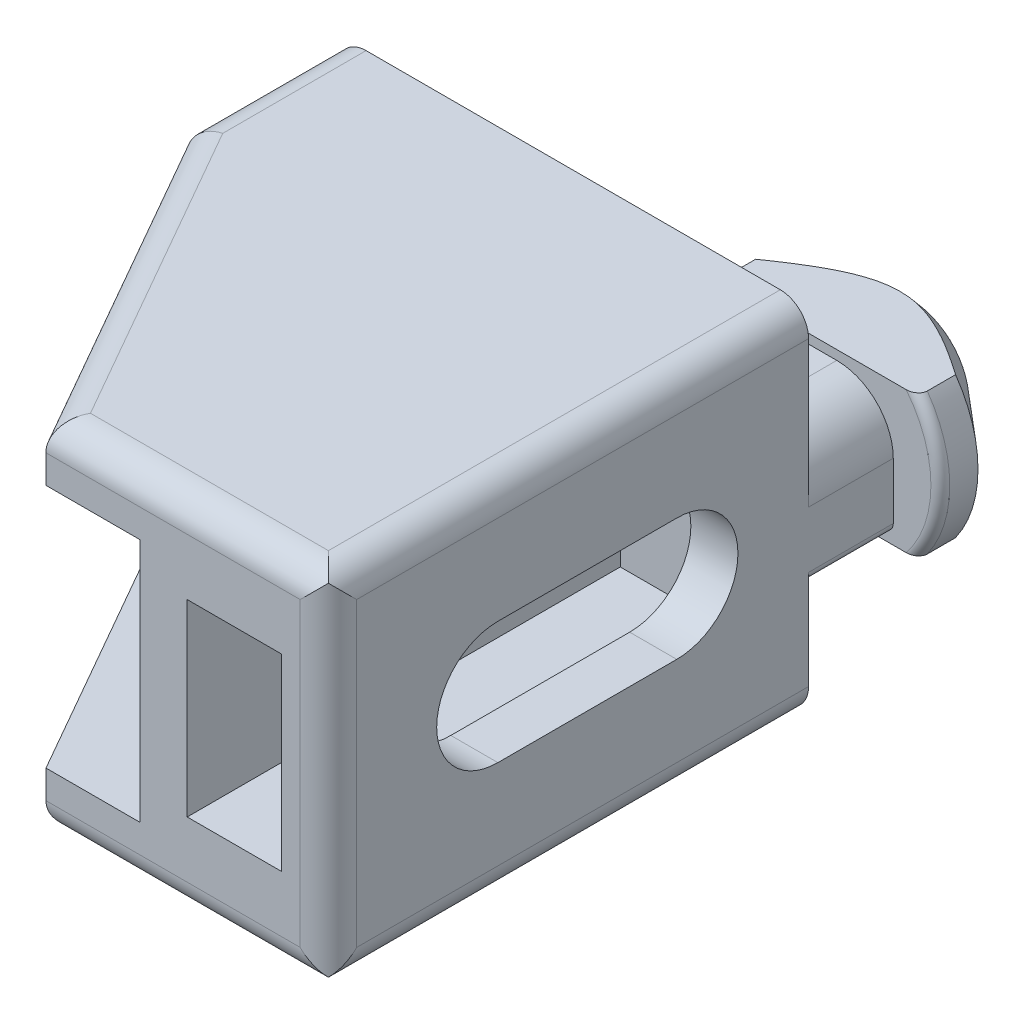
ISO-10303-21;
HEADER;
FILE_DESCRIPTION(('STEP AP214'),'2;1');
FILE_NAME('part.step','',(''),(''),'','','');
FILE_SCHEMA(('AUTOMOTIVE_DESIGN { 1 0 10303 214 1 1 1 1 }'));
ENDSEC;
DATA;
#1=APPLICATION_CONTEXT('core data for automotive mechanical design processes');
#2=APPLICATION_PROTOCOL_DEFINITION('international standard','automotive_design',2000,#1);
#3=PRODUCT_CONTEXT('',#1,'mechanical');
#4=PRODUCT('Part','Part','',(#3));
#5=PRODUCT_RELATED_PRODUCT_CATEGORY('part','',(#4));
#6=PRODUCT_DEFINITION_FORMATION('','',#4);
#7=PRODUCT_DEFINITION_CONTEXT('part definition',#1,'design');
#8=PRODUCT_DEFINITION('design','',#6,#7);
#9=PRODUCT_DEFINITION_SHAPE('','',#8);
#10=(LENGTH_UNIT() NAMED_UNIT(*) SI_UNIT(.MILLI.,.METRE.));
#11=(NAMED_UNIT(*) PLANE_ANGLE_UNIT() SI_UNIT($,.RADIAN.));
#12=(NAMED_UNIT(*) SI_UNIT($,.STERADIAN.) SOLID_ANGLE_UNIT());
#13=UNCERTAINTY_MEASURE_WITH_UNIT(LENGTH_MEASURE(1.E-05),#10,'distance_accuracy_value','');
#14=(GEOMETRIC_REPRESENTATION_CONTEXT(3) GLOBAL_UNCERTAINTY_ASSIGNED_CONTEXT((#13)) GLOBAL_UNIT_ASSIGNED_CONTEXT((#10,
#11,#12)) REPRESENTATION_CONTEXT('',''));
#15=CARTESIAN_POINT('',(0.,0.,0.));
#16=DIRECTION('',(0.,0.,1.));
#17=DIRECTION('',(1.,0.,0.));
#18=AXIS2_PLACEMENT_3D('',#15,#16,#17);
#19=CARTESIAN_POINT('',(2.82,2.26032237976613,0.));
#20=DIRECTION('',(0.,0.,-1.));
#21=DIRECTION('',(-1.,0.,0.));
#22=AXIS2_PLACEMENT_3D('',#19,#20,#21);
#23=PLANE('',#22);
#24=CARTESIAN_POINT('',(2.82,0.,0.));
#25=DIRECTION('',(0.,0.,1.));
#26=DIRECTION('',(0.,1.,0.));
#27=AXIS2_PLACEMENT_3D('',#24,#25,#26);
#28=CIRCLE('',#27,2.81503796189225);
#29=CARTESIAN_POINT('',(2.82,2.81503796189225,0.));
#30=VERTEX_POINT('',#29);
#31=EDGE_CURVE('E292',#30,#30,#28,.T.);
#32=ORIENTED_EDGE('',*,*,#31,.F.);
#33=EDGE_LOOP('',(#32));
#34=FACE_BOUND('',#33,.T.);
#35=ADVANCED_FACE('F15',(#34),#23,.T.);
#36=CARTESIAN_POINT('',(2.82,0.,0.500000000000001));
#37=DIRECTION('',(0.,0.,1.));
#38=DIRECTION('',(0.,1.,0.));
#39=AXIS2_PLACEMENT_3D('',#36,#37,#38);
#40=TOROIDAL_SURFACE('',#39,2.81503796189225,0.500000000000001);
#41=ORIENTED_EDGE('',*,*,#31,.T.);
#42=EDGE_LOOP('',(#41));
#43=FACE_BOUND('',#42,.T.);
#44=CARTESIAN_POINT('',(2.82,0.,0.120371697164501));
#45=DIRECTION('',(0.,0.,1.));
#46=DIRECTION('',(0.,1.,0.));
#47=AXIS2_PLACEMENT_3D('',#44,#45,#46);
#48=CIRCLE('',#47,3.14043365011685);
#49=CARTESIAN_POINT('',(2.82,3.14043365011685,0.120371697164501));
#50=VERTEX_POINT('',#49);
#51=EDGE_CURVE('E283',#50,#50,#48,.T.);
#52=ORIENTED_EDGE('',*,*,#51,.F.);
#53=EDGE_LOOP('',(#52));
#54=FACE_BOUND('',#53,.T.);
#55=ADVANCED_FACE('F297',(#43,#54),#40,.T.);
#56=CARTESIAN_POINT('',(2.82,0.,3.75));
#57=DIRECTION('',(0.,0.,1.));
#58=DIRECTION('',(1.,0.,0.));
#59=AXIS2_PLACEMENT_3D('',#56,#57,#58);
#60=CYLINDRICAL_SURFACE('',#59,6.49999999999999);
#61=DIRECTION('',(0.,0.,1.));
#62=VECTOR('',#61,1.);
#63=CARTESIAN_POINT('',(-2.48919014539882,-3.75,3.75));
#64=LINE('',#63,#62);
#65=CARTESIAN_POINT('',(-2.48919014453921,-3.75,3.00000000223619));
#66=VERTEX_POINT('',#65);
#67=CARTESIAN_POINT('',(-2.48919014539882,-3.75,4.5));
#68=VERTEX_POINT('',#67);
#69=EDGE_CURVE('E290',#66,#68,#64,.T.);
#70=ORIENTED_EDGE('',*,*,#69,.T.);
#71=CARTESIAN_POINT('',(2.82,0.,4.5));
#72=DIRECTION('',(0.,0.,1.));
#73=DIRECTION('',(0.,1.,0.));
#74=AXIS2_PLACEMENT_3D('',#71,#72,#73);
#75=CIRCLE('',#74,6.5);
#76=CARTESIAN_POINT('',(-2.48919014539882,3.75,4.5));
#77=VERTEX_POINT('',#76);
#78=EDGE_CURVE('E586',#77,#68,#75,.T.);
#79=ORIENTED_EDGE('',*,*,#78,.F.);
#80=DIRECTION('',(0.,0.,1.));
#81=VECTOR('',#80,1.);
#82=CARTESIAN_POINT('',(-2.48919014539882,3.75,5.));
#83=LINE('',#82,#81);
#84=CARTESIAN_POINT('',(-2.48919014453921,3.75,3.00000000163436));
#85=VERTEX_POINT('',#84);
#86=EDGE_CURVE('E615',#85,#77,#83,.T.);
#87=ORIENTED_EDGE('',*,*,#86,.F.);
#88=CARTESIAN_POINT('',(2.82,0.,3.00000000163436));
#89=DIRECTION('',(0.,0.,1.));
#90=DIRECTION('',(0.,1.,0.));
#91=AXIS2_PLACEMENT_3D('',#88,#89,#90);
#92=CIRCLE('',#91,6.49999999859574);
#93=EDGE_CURVE('E286',#66,#85,#92,.F.);
#94=ORIENTED_EDGE('',*,*,#93,.F.);
#95=EDGE_LOOP('',(#70,#79,#87,#94));
#96=FACE_BOUND('',#95,.T.);
#97=ADVANCED_FACE('F301',(#96),#60,.T.);
#98=CARTESIAN_POINT('',(2.82,0.,3.00000000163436));
#99=DIRECTION('',(0.,0.,1.));
#100=DIRECTION('',(1.,0.,0.));
#101=AXIS2_PLACEMENT_3D('',#98,#99,#100);
#102=CONICAL_SURFACE('',#101,6.49999999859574,0.862170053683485);
#103=ORIENTED_EDGE('',*,*,#51,.T.);
#104=EDGE_LOOP('',(#103));
#105=FACE_BOUND('',#104,.T.);
#106=CARTESIAN_POINT('',(-2.48919014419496,-3.7500000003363,3.00000000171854));
#107=CARTESIAN_POINT('',(-2.38102064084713,-3.75000000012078,2.9242779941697));
#108=CARTESIAN_POINT('',(-2.27249512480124,-3.75000000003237,2.84905991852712));
#109=CARTESIAN_POINT('',(-2.05460923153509,-3.74999999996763,2.69982502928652));
#110=CARTESIAN_POINT('',(-1.94524878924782,-3.74999999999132,2.62580831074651));
#111=CARTESIAN_POINT('',(-1.7253579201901,-3.7500000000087,2.47902847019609));
#112=CARTESIAN_POINT('',(-1.61482552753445,-3.75000000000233,2.4062682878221));
#113=CARTESIAN_POINT('',(-1.39267873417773,-3.74999999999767,2.26242116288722));
#114=CARTESIAN_POINT('',(-1.28106435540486,-3.74999999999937,2.19133418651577));
#115=CARTESIAN_POINT('',(-1.05295268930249,-3.75000000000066,2.04887841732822));
#116=CARTESIAN_POINT('',(-0.936414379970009,-3.75000000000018,1.9775751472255));
#117=CARTESIAN_POINT('',(-0.701808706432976,-3.74999999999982,1.83753204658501));
#118=CARTESIAN_POINT('',(-0.583741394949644,-3.74999999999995,1.76879212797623));
#119=CARTESIAN_POINT('',(-0.345925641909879,-3.75000000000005,1.63447874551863));
#120=CARTESIAN_POINT('',(-0.226178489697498,-3.75000000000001,1.56890300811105));
#121=CARTESIAN_POINT('',(0.0153293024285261,-3.74999999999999,1.44157609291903));
#122=CARTESIAN_POINT('',(0.137089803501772,-3.75,1.3798246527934));
#123=CARTESIAN_POINT('',(0.401717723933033,-3.75,1.25193561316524));
#124=CARTESIAN_POINT('',(0.5449633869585,-3.75,1.18657321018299));
#125=CARTESIAN_POINT('',(0.834894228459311,-3.75,1.06383364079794));
#126=CARTESIAN_POINT('',(0.981579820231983,-3.75,1.00645743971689));
#127=CARTESIAN_POINT('',(1.27734191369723,-3.75,0.902303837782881));
#128=CARTESIAN_POINT('',(1.42638828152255,-3.75,0.855442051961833));
#129=CARTESIAN_POINT('',(1.72782173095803,-3.75,0.774168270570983));
#130=CARTESIAN_POINT('',(1.88020684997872,-3.75,0.739749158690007));
#131=CARTESIAN_POINT('',(2.16219872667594,-3.75,0.690158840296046));
#132=CARTESIAN_POINT('',(2.29140840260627,-3.75,0.672746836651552));
#133=CARTESIAN_POINT('',(2.5508549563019,-3.75,0.649229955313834));
#134=CARTESIAN_POINT('',(2.68109166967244,-3.75,0.643123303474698));
#135=CARTESIAN_POINT('',(2.94157648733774,-3.75,0.64260814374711));
#136=CARTESIAN_POINT('',(3.07182458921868,-3.75,0.648198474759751));
#137=CARTESIAN_POINT('',(3.33133330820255,-3.75,0.6707106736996));
#138=CARTESIAN_POINT('',(3.46059376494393,-3.75,0.68763434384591));
#139=CARTESIAN_POINT('',(3.76362307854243,-3.75,0.739814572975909));
#140=CARTESIAN_POINT('',(3.93663175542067,-3.75,0.779481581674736));
#141=CARTESIAN_POINT('',(4.27826220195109,-3.75,0.874543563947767));
#142=CARTESIAN_POINT('',(4.44688093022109,-3.75,0.92994914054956));
#143=CARTESIAN_POINT('',(4.78124123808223,-3.75,1.0535836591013));
#144=CARTESIAN_POINT('',(4.94693562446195,-3.75,1.12193819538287));
#145=CARTESIAN_POINT('',(5.27401194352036,-3.75,1.26807535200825));
#146=CARTESIAN_POINT('',(5.43539473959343,-3.75,1.34585606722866));
#147=CARTESIAN_POINT('',(5.82007645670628,-3.75,1.54197333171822));
#148=CARTESIAN_POINT('',(6.04156346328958,-3.75,1.66384002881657));
#149=CARTESIAN_POINT('',(6.47895736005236,-3.75,1.91729789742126));
#150=CARTESIAN_POINT('',(6.69486145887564,-3.75,2.04889381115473));
#151=CARTESIAN_POINT('',(7.11565002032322,-3.75,2.31470280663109));
#152=CARTESIAN_POINT('',(7.32066801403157,-3.75,2.4487056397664));
#153=CARTESIAN_POINT('',(7.62568236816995,-3.75,2.65314376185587));
#154=CARTESIAN_POINT('',(7.72686965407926,-3.75,2.72181605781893));
#155=CARTESIAN_POINT('',(7.92853665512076,-3.75,2.86017977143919));
#156=CARTESIAN_POINT('',(8.02901641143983,-3.75,2.92987112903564));
#157=CARTESIAN_POINT('',(8.12919014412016,-3.75,3.00000000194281));
#158=B_SPLINE_CURVE_WITH_KNOTS('',3,(#106,#107,#108,#109,#110,#111,#112,#113,#114,#115,#116,
#117,#118,#119,#120,#121,#122,#123,#124,#125,#126,#127,#128,#129,#130,#131,#132,#133,#134,#135,
#136,#137,#138,#139,#140,#141,#142,#143,#144,#145,#146,#147,#148,#149,#150,#151,#152,#153,#154,
#155,#156,#157),.UNSPECIFIED.,.F.,.F.,(4,2,2,2,2,2,2,2,2,2,2,2,2,2,2,2,2,2,2,2,2,2,2,2,2,4),(0.,
0.396121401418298,0.792273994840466,1.18925361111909,1.5862251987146,1.99606135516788,
2.40588341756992,2.81540648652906,3.22490143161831,3.69706996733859,4.16929552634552,
4.63758361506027,5.10560345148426,5.49628403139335,5.88690329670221,6.27748378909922,
6.66812640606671,7.1996497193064,7.7315319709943,8.26886491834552,8.8060894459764,
9.56410185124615,10.3224861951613,11.0571744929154,11.4240388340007,11.7908816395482),.UNSPECIFIED.);
#159=CARTESIAN_POINT('',(8.12919014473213,-3.75,3.00000000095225));
#160=VERTEX_POINT('',#159);
#161=EDGE_CURVE('E583',#66,#160,#158,.T.);
#162=ORIENTED_EDGE('',*,*,#161,.F.);
#163=ORIENTED_EDGE('',*,*,#93,.T.);
#164=CARTESIAN_POINT('',(8.12919014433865,3.75000000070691,3.00000000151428));
#165=CARTESIAN_POINT('',(8.02102064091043,3.7500000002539,2.92427799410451));
#166=CARTESIAN_POINT('',(7.91249512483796,3.75000000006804,2.84905991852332));
#167=CARTESIAN_POINT('',(7.69460923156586,3.74999999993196,2.69982502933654));
#168=CARTESIAN_POINT('',(7.58524878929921,3.74999999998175,2.62580831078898));
#169=CARTESIAN_POINT('',(7.36535792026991,3.75000000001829,2.47902847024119));
#170=CARTESIAN_POINT('',(7.25482552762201,3.75000000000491,2.40626828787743));
#171=CARTESIAN_POINT('',(7.03267873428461,3.74999999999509,2.2624211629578));
#172=CARTESIAN_POINT('',(6.92106435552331,3.74999999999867,2.19133418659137));
#173=CARTESIAN_POINT('',(6.69295268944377,3.75000000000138,2.04887841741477));
#174=CARTESIAN_POINT('',(6.57641438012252,3.75000000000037,1.97757514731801));
#175=CARTESIAN_POINT('',(6.34180870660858,3.74999999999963,1.83753204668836));
#176=CARTESIAN_POINT('',(6.2237413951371,3.7499999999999,1.76879212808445));
#177=CARTESIAN_POINT('',(5.9859256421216,3.7500000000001,1.63447874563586));
#178=CARTESIAN_POINT('',(5.86617848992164,3.75000000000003,1.56890300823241));
#179=CARTESIAN_POINT('',(5.62467069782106,3.74999999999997,1.44157609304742));
#180=CARTESIAN_POINT('',(5.50291019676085,3.74999999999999,1.37982465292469));
#181=CARTESIAN_POINT('',(5.23828227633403,3.75000000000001,1.25193561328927));
#182=CARTESIAN_POINT('',(5.09503661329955,3.75,1.18657321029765));
#183=CARTESIAN_POINT('',(4.80510577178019,3.75,1.06383364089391));
#184=CARTESIAN_POINT('',(4.658420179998,3.75,1.00645743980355));
#185=CARTESIAN_POINT('',(4.36265808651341,3.75,0.902303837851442));
#186=CARTESIAN_POINT('',(4.21361171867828,3.75,0.855442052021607));
#187=CARTESIAN_POINT('',(3.91217826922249,3.75,0.774168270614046));
#188=CARTESIAN_POINT('',(3.75979315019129,3.75,0.739749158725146));
#189=CARTESIAN_POINT('',(3.47780127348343,3.75,0.690158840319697));
#190=CARTESIAN_POINT('',(3.34859159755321,3.75,0.672746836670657));
#191=CARTESIAN_POINT('',(3.08914504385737,3.75,0.649229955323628));
#192=CARTESIAN_POINT('',(2.95890833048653,3.75,0.64312330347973));
#193=CARTESIAN_POINT('',(2.69842351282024,3.75,0.642608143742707));
#194=CARTESIAN_POINT('',(2.56817541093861,3.75,0.64819847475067));
#195=CARTESIAN_POINT('',(2.308666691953,3.75,0.670710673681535));
#196=CARTESIAN_POINT('',(2.17940623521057,3.75,0.687634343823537));
#197=CARTESIAN_POINT('',(1.87637692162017,3.75,0.739814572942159));
#198=CARTESIAN_POINT('',(1.70336824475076,3.75,0.779481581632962));
#199=CARTESIAN_POINT('',(1.36173779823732,3.75,0.874543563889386));
#200=CARTESIAN_POINT('',(1.19311906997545,3.75,0.929949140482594));
#201=CARTESIAN_POINT('',(0.858758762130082,3.75,1.05358365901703));
#202=CARTESIAN_POINT('',(0.693064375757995,3.75,1.12193819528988));
#203=CARTESIAN_POINT('',(0.36598805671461,3.75,1.26807535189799));
#204=CARTESIAN_POINT('',(0.204605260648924,3.75,1.34585606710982));
#205=CARTESIAN_POINT('',(-0.180076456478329,3.75,1.54197333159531));
#206=CARTESIAN_POINT('',(-0.401563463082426,3.75,1.66384002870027));
#207=CARTESIAN_POINT('',(-0.838957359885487,3.75,1.91729789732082));
#208=CARTESIAN_POINT('',(-1.05486145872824,3.75,2.04889381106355));
#209=CARTESIAN_POINT('',(-1.47565002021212,3.75,2.31470280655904));
#210=CARTESIAN_POINT('',(-1.68066801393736,3.75,2.44870563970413));
#211=CARTESIAN_POINT('',(-1.98568236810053,3.75,2.65314376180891));
#212=CARTESIAN_POINT('',(-2.08686965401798,3.75,2.72181605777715));
#213=CARTESIAN_POINT('',(-2.28853665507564,3.75,2.86017977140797));
#214=CARTESIAN_POINT('',(-2.38901641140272,3.75,2.92987112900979));
#215=CARTESIAN_POINT('',(-2.48919014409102,3.75,3.0000000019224));
#216=B_SPLINE_CURVE_WITH_KNOTS('',3,(#164,#165,#166,#167,#168,#169,#170,#171,#172,#173,#174,
#175,#176,#177,#178,#179,#180,#181,#182,#183,#184,#185,#186,#187,#188,#189,#190,#191,#192,#193,
#194,#195,#196,#197,#198,#199,#200,#201,#202,#203,#204,#205,#206,#207,#208,#209,#210,#211,#212,
#213,#214,#215),.UNSPECIFIED.,.F.,.F.,(4,2,2,2,2,2,2,2,2,2,2,2,2,2,2,2,2,2,2,2,2,2,2,2,2,4),(0.,
0.396121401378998,0.792273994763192,1.18925361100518,1.58622519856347,1.99606135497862,
2.40588341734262,2.81540648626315,3.22490143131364,3.6970699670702,4.16929552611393,
4.63758361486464,5.10560345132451,5.49628403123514,5.88690329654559,6.27748378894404,
6.66812640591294,7.19964971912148,7.73153197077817,8.26886491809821,8.80608944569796,
9.56410185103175,10.3224861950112,11.0571744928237,11.4240388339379,11.7908816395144),.UNSPECIFIED.);
#217=CARTESIAN_POINT('',(8.12919014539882,3.75,3.000000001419));
#218=VERTEX_POINT('',#217);
#219=EDGE_CURVE('E616',#218,#85,#216,.T.);
#220=ORIENTED_EDGE('',*,*,#219,.F.);
#221=CARTESIAN_POINT('',(2.82,0.,3.));
#222=DIRECTION('',(0.,0.,1.));
#223=DIRECTION('',(1.,0.,0.));
#224=AXIS2_PLACEMENT_3D('',#221,#222,#223);
#225=CIRCLE('',#224,6.49999999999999);
#226=EDGE_CURVE('E273',#160,#218,#225,.T.);
#227=ORIENTED_EDGE('',*,*,#226,.F.);
#228=EDGE_LOOP('',(#162,#163,#220,#227));
#229=FACE_BOUND('',#228,.T.);
#230=ADVANCED_FACE('F628',(#105,#229),#102,.T.);
#231=CARTESIAN_POINT('',(2.82,0.,3.75));
#232=DIRECTION('',(0.,0.,1.));
#233=DIRECTION('',(1.,0.,0.));
#234=AXIS2_PLACEMENT_3D('',#231,#232,#233);
#235=CYLINDRICAL_SURFACE('',#234,6.49999999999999);
#236=DIRECTION('',(0.,0.,-1.));
#237=VECTOR('',#236,1.);
#238=CARTESIAN_POINT('',(8.12919014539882,-3.75,5.));
#239=LINE('',#238,#237);
#240=CARTESIAN_POINT('',(8.12919014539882,-3.75,4.5));
#241=VERTEX_POINT('',#240);
#242=EDGE_CURVE('E575',#160,#241,#239,.F.);
#243=ORIENTED_EDGE('',*,*,#242,.F.);
#244=ORIENTED_EDGE('',*,*,#226,.T.);
#245=DIRECTION('',(0.,0.,1.));
#246=VECTOR('',#245,1.);
#247=CARTESIAN_POINT('',(8.12919014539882,3.75,5.));
#248=LINE('',#247,#246);
#249=CARTESIAN_POINT('',(8.12919014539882,3.75,4.5));
#250=VERTEX_POINT('',#249);
#251=EDGE_CURVE('E609',#250,#218,#248,.F.);
#252=ORIENTED_EDGE('',*,*,#251,.F.);
#253=CARTESIAN_POINT('',(2.82,0.,4.5));
#254=DIRECTION('',(0.,0.,1.));
#255=DIRECTION('',(0.,1.,0.));
#256=AXIS2_PLACEMENT_3D('',#253,#254,#255);
#257=CIRCLE('',#256,6.5);
#258=EDGE_CURVE('E263',#241,#250,#257,.T.);
#259=ORIENTED_EDGE('',*,*,#258,.F.);
#260=EDGE_LOOP('',(#243,#244,#252,#259));
#261=FACE_BOUND('',#260,.T.);
#262=ADVANCED_FACE('F632',(#261),#235,.T.);
#263=CARTESIAN_POINT('',(-23.6248562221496,-8.,10.9881949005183));
#264=DIRECTION('',(0.,1.,0.));
#265=DIRECTION('',(0.,0.,1.));
#266=AXIS2_PLACEMENT_3D('',#263,#264,#265);
#267=PLANE('',#266);
#268=DIRECTION('',(0.496138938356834,0.,0.868243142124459));
#269=VECTOR('',#268,1.);
#270=CARTESIAN_POINT('',(-18.18,-8.00000000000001,17.4999999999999));
#271=LINE('',#270,#269);
#272=CARTESIAN_POINT('',(-18.18,-8.00000000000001,17.4999999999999));
#273=VERTEX_POINT('',#272);
#274=CARTESIAN_POINT('',(-8.17999999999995,-8.00000000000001,35.));
#275=VERTEX_POINT('',#274);
#276=EDGE_CURVE('E256',#273,#275,#271,.T.);
#277=ORIENTED_EDGE('',*,*,#276,.F.);
#278=DIRECTION('',(0.,0.,1.));
#279=VECTOR('',#278,1.);
#280=CARTESIAN_POINT('',(-18.18,-8.,10.9881949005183));
#281=LINE('',#280,#279);
#282=CARTESIAN_POINT('',(-18.18,-8.,17.4947805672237));
#283=VERTEX_POINT('',#282);
#284=EDGE_CURVE('E266',#283,#273,#281,.T.);
#285=ORIENTED_EDGE('',*,*,#284,.F.);
#286=DIRECTION('',(0.49606496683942,0.,0.868285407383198));
#287=VECTOR('',#286,1.);
#288=CARTESIAN_POINT('',(-22.3224281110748,-8.,10.2440974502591));
#289=LINE('',#288,#287);
#290=CARTESIAN_POINT('',(-8.17899569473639,-8.,35.));
#291=VERTEX_POINT('',#290);
#292=EDGE_CURVE('E471',#291,#283,#289,.F.);
#293=ORIENTED_EDGE('',*,*,#292,.F.);
#294=DIRECTION('',(1.,0.,0.));
#295=VECTOR('',#294,1.);
#296=CARTESIAN_POINT('',(-3.18,-8.,35.));
#297=LINE('',#296,#295);
#298=EDGE_CURVE('E19',#275,#291,#297,.T.);
#299=ORIENTED_EDGE('',*,*,#298,.F.);
#300=EDGE_LOOP('',(#277,#285,#293,#299));
#301=FACE_BOUND('',#300,.T.);
#302=ADVANCED_FACE('F275',(#301),#267,.F.);
#303=CARTESIAN_POINT('',(2.82,3.75,5.));
#304=DIRECTION('',(0.,1.,0.));
#305=DIRECTION('',(0.,0.,1.));
#306=AXIS2_PLACEMENT_3D('',#303,#304,#305);
#307=PLANE('',#306);
#308=CARTESIAN_POINT('',(8.12919014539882,3.75,4.5));
#309=CARTESIAN_POINT('',(8.12923162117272,3.75,4.52439826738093));
#310=CARTESIAN_POINT('',(8.12700683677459,3.75,4.54876223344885));
#311=CARTESIAN_POINT('',(8.11836577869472,3.75,4.59660709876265));
#312=CARTESIAN_POINT('',(8.11197181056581,3.75,4.62009199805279));
#313=CARTESIAN_POINT('',(8.09533725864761,3.75,4.66560968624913));
#314=CARTESIAN_POINT('',(8.0851014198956,3.75,4.68764422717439));
#315=CARTESIAN_POINT('',(8.06128514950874,3.75,4.72983732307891));
#316=CARTESIAN_POINT('',(8.04770109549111,3.75,4.7499938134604));
#317=CARTESIAN_POINT('',(8.01682194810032,3.75,4.7892595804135));
#318=CARTESIAN_POINT('',(7.9993509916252,3.75,4.80822991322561));
#319=CARTESIAN_POINT('',(7.96188107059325,3.75,4.84351113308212));
#320=CARTESIAN_POINT('',(7.94187779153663,3.75,4.85981736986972));
#321=CARTESIAN_POINT('',(7.8717971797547,3.75,4.90968137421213));
#322=CARTESIAN_POINT('',(7.81729779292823,3.75,4.93712248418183));
#323=CARTESIAN_POINT('',(7.69190727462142,3.75,4.98135223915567));
#324=CARTESIAN_POINT('',(7.6199162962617,3.75,4.99491865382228));
#325=CARTESIAN_POINT('',(7.53307295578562,3.75,4.99960677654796));
#326=CARTESIAN_POINT('',(7.5184002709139,3.75,4.99999926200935));
#327=CARTESIAN_POINT('',(7.50374849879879,3.75,5.));
#328=B_SPLINE_CURVE_WITH_KNOTS('',3,(#308,#309,#310,#311,#312,#313,#314,#315,#316,#317,#318,
#319,#320,#321,#322,#323,#324,#325,#326,#327),.UNSPECIFIED.,.F.,.F.,(4,2,2,2,2,2,2,2,2,4),(0.,
0.0730394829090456,0.145691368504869,0.218253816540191,0.290895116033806,0.367968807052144,
0.445175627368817,0.625705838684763,0.842292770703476,0.886298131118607),.UNSPECIFIED.);
#329=CARTESIAN_POINT('',(7.50374849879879,3.75,5.));
#330=VERTEX_POINT('',#329);
#331=EDGE_CURVE('E464',#250,#330,#328,.T.);
#332=ORIENTED_EDGE('',*,*,#331,.F.);
#333=ORIENTED_EDGE('',*,*,#251,.T.);
#334=ORIENTED_EDGE('',*,*,#219,.T.);
#335=ORIENTED_EDGE('',*,*,#86,.T.);
#336=CARTESIAN_POINT('',(-1.86374849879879,3.75,5.));
#337=CARTESIAN_POINT('',(-1.88488198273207,3.75,4.99999863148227));
#338=CARTESIAN_POINT('',(-1.90601855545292,3.75,4.99918333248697));
#339=CARTESIAN_POINT('',(-1.94814287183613,3.75,4.99589052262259));
#340=CARTESIAN_POINT('',(-1.96913072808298,3.75,4.99341444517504));
#341=CARTESIAN_POINT('',(-2.01097753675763,3.75,4.98674384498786));
#342=CARTESIAN_POINT('',(-2.03183471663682,3.75,4.98253805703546));
#343=CARTESIAN_POINT('',(-2.07314409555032,3.75,4.97235961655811));
#344=CARTESIAN_POINT('',(-2.09359563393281,3.75,4.96638429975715));
#345=CARTESIAN_POINT('',(-2.14692806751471,3.75,4.94816853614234));
#346=CARTESIAN_POINT('',(-2.17929804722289,3.75,4.93437498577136));
#347=CARTESIAN_POINT('',(-2.24134277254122,3.75,4.90173266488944));
#348=CARTESIAN_POINT('',(-2.27102236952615,3.75,4.88289324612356));
#349=CARTESIAN_POINT('',(-2.32144914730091,3.75,4.84402815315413));
#350=CARTESIAN_POINT('',(-2.34283950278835,3.75,4.8248399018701));
#351=CARTESIAN_POINT('',(-2.38221028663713,3.75,4.78318905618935));
#352=CARTESIAN_POINT('',(-2.40018990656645,3.75,4.76072568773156));
#353=CARTESIAN_POINT('',(-2.43195424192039,3.75,4.71270550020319));
#354=CARTESIAN_POINT('',(-2.445702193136,3.75,4.6871241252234));
#355=CARTESIAN_POINT('',(-2.46786741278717,3.75,4.63376516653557));
#356=CARTESIAN_POINT('',(-2.47629720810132,3.75,4.60599291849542));
#357=CARTESIAN_POINT('',(-2.48422194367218,3.75,4.56488761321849));
#358=CARTESIAN_POINT('',(-2.48608176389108,3.75,4.5519777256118));
#359=CARTESIAN_POINT('',(-2.48856583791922,3.75,4.52604829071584));
#360=CARTESIAN_POINT('',(-2.48919089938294,3.75,4.51302882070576));
#361=CARTESIAN_POINT('',(-2.48919014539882,3.75,4.5));
#362=B_SPLINE_CURVE_WITH_KNOTS('',3,(#336,#337,#338,#339,#340,#341,#342,#343,#344,#345,#346,
#347,#348,#349,#350,#351,#352,#353,#354,#355,#356,#357,#358,#359,#360,#361),.UNSPECIFIED.,.F.,
.F.,(4,2,2,2,2,2,2,2,2,2,2,2,4),(0.,0.0633891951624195,0.126723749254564,0.190477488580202,
0.254327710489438,0.359450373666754,0.464379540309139,0.550244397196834,0.636129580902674,
0.722741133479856,0.809147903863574,0.84822684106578,0.887280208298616),.UNSPECIFIED.);
#363=CARTESIAN_POINT('',(-1.86374849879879,3.75,5.));
#364=VERTEX_POINT('',#363);
#365=EDGE_CURVE('E466',#364,#77,#362,.T.);
#366=ORIENTED_EDGE('',*,*,#365,.F.);
#367=DIRECTION('',(1.,0.,0.));
#368=VECTOR('',#367,1.);
#369=CARTESIAN_POINT('',(2.82,3.75,5.));
#370=LINE('',#369,#368);
#371=EDGE_CURVE('E450',#330,#364,#370,.F.);
#372=ORIENTED_EDGE('',*,*,#371,.F.);
#373=EDGE_LOOP('',(#332,#333,#334,#335,#366,#372));
#374=FACE_BOUND('',#373,.T.);
#375=ADVANCED_FACE('F462',(#374),#307,.T.);
#376=CARTESIAN_POINT('',(2.82,0.,4.5));
#377=DIRECTION('',(0.,0.,1.));
#378=DIRECTION('',(0.,1.,0.));
#379=AXIS2_PLACEMENT_3D('',#376,#377,#378);
#380=TOROIDAL_SURFACE('',#379,5.99999999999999,0.500000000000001);
#381=CARTESIAN_POINT('',(-1.86374849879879,-3.75,5.));
#382=CARTESIAN_POINT('',(-1.88488198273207,-3.75,4.99999863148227));
#383=CARTESIAN_POINT('',(-1.90601855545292,-3.75,4.99918333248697));
#384=CARTESIAN_POINT('',(-1.94814287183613,-3.75,4.99589052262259));
#385=CARTESIAN_POINT('',(-1.96913072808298,-3.75,4.99341444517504));
#386=CARTESIAN_POINT('',(-2.01097753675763,-3.75,4.98674384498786));
#387=CARTESIAN_POINT('',(-2.03183471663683,-3.75,4.98253805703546));
#388=CARTESIAN_POINT('',(-2.07314409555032,-3.75,4.97235961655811));
#389=CARTESIAN_POINT('',(-2.09359563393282,-3.75,4.96638429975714));
#390=CARTESIAN_POINT('',(-2.14692806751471,-3.75,4.94816853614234));
#391=CARTESIAN_POINT('',(-2.17929804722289,-3.75,4.93437498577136));
#392=CARTESIAN_POINT('',(-2.24134277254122,-3.75,4.90173266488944));
#393=CARTESIAN_POINT('',(-2.27102236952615,-3.75,4.88289324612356));
#394=CARTESIAN_POINT('',(-2.32144914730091,-3.75,4.84402815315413));
#395=CARTESIAN_POINT('',(-2.34283950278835,-3.75,4.8248399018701));
#396=CARTESIAN_POINT('',(-2.38221028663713,-3.75,4.78318905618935));
#397=CARTESIAN_POINT('',(-2.40018990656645,-3.75,4.76072568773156));
#398=CARTESIAN_POINT('',(-2.4319542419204,-3.75,4.71270550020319));
#399=CARTESIAN_POINT('',(-2.445702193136,-3.75,4.6871241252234));
#400=CARTESIAN_POINT('',(-2.46786741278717,-3.75,4.63376516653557));
#401=CARTESIAN_POINT('',(-2.47629720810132,-3.74999999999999,4.60599291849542));
#402=CARTESIAN_POINT('',(-2.48422194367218,-3.75,4.56488761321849));
#403=CARTESIAN_POINT('',(-2.48608176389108,-3.75,4.5519777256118));
#404=CARTESIAN_POINT('',(-2.48856583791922,-3.75,4.52604829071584));
#405=CARTESIAN_POINT('',(-2.48919089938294,-3.75,4.51302882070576));
#406=CARTESIAN_POINT('',(-2.48919014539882,-3.75,4.5));
#407=B_SPLINE_CURVE_WITH_KNOTS('',3,(#381,#382,#383,#384,#385,#386,#387,#388,#389,#390,#391,
#392,#393,#394,#395,#396,#397,#398,#399,#400,#401,#402,#403,#404,#405,#406),.UNSPECIFIED.,.F.,
.F.,(4,2,2,2,2,2,2,2,2,2,2,2,4),(0.,0.0633891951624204,0.126723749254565,0.190477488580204,
0.254327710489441,0.359450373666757,0.46437954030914,0.550244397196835,0.636129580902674,
0.722741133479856,0.809147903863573,0.848226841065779,0.887280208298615),.UNSPECIFIED.);
#408=CARTESIAN_POINT('',(-1.86374849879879,-3.75,5.));
#409=VERTEX_POINT('',#408);
#410=EDGE_CURVE('E582',#409,#68,#407,.T.);
#411=ORIENTED_EDGE('',*,*,#410,.F.);
#412=CARTESIAN_POINT('',(2.82,0.,5.));
#413=DIRECTION('',(0.,0.,-1.));
#414=DIRECTION('',(-0.780624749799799,-0.625,0.));
#415=AXIS2_PLACEMENT_3D('',#412,#413,#414);
#416=CIRCLE('',#415,5.99999999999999);
#417=EDGE_CURVE('E468',#364,#409,#416,.F.);
#418=ORIENTED_EDGE('',*,*,#417,.F.);
#419=ORIENTED_EDGE('',*,*,#365,.T.);
#420=ORIENTED_EDGE('',*,*,#78,.T.);
#421=EDGE_LOOP('',(#411,#418,#419,#420));
#422=FACE_BOUND('',#421,.T.);
#423=ADVANCED_FACE('F588',(#422),#380,.T.);
#424=CARTESIAN_POINT('',(2.82,-3.75,5.));
#425=DIRECTION('',(0.,-1.,0.));
#426=DIRECTION('',(0.,0.,-1.));
#427=AXIS2_PLACEMENT_3D('',#424,#425,#426);
#428=PLANE('',#427);
#429=ORIENTED_EDGE('',*,*,#410,.T.);
#430=ORIENTED_EDGE('',*,*,#69,.F.);
#431=ORIENTED_EDGE('',*,*,#161,.T.);
#432=ORIENTED_EDGE('',*,*,#242,.T.);
#433=CARTESIAN_POINT('',(7.5037484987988,-3.75,5.));
#434=CARTESIAN_POINT('',(7.52488198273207,-3.75,4.99999863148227));
#435=CARTESIAN_POINT('',(7.54601855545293,-3.75,4.99918333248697));
#436=CARTESIAN_POINT('',(7.58814287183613,-3.75,4.99589052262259));
#437=CARTESIAN_POINT('',(7.60913072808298,-3.75,4.99341444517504));
#438=CARTESIAN_POINT('',(7.65097753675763,-3.75,4.98674384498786));
#439=CARTESIAN_POINT('',(7.67183471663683,-3.75,4.98253805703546));
#440=CARTESIAN_POINT('',(7.71314409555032,-3.75,4.97235961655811));
#441=CARTESIAN_POINT('',(7.73359563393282,-3.75,4.96638429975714));
#442=CARTESIAN_POINT('',(7.78692806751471,-3.75,4.94816853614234));
#443=CARTESIAN_POINT('',(7.81929804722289,-3.75,4.93437498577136));
#444=CARTESIAN_POINT('',(7.88134277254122,-3.75,4.90173266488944));
#445=CARTESIAN_POINT('',(7.91102236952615,-3.75,4.88289324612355));
#446=CARTESIAN_POINT('',(7.96144914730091,-3.75,4.84402815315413));
#447=CARTESIAN_POINT('',(7.98283950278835,-3.75,4.8248399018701));
#448=CARTESIAN_POINT('',(8.02221028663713,-3.75,4.78318905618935));
#449=CARTESIAN_POINT('',(8.04018990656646,-3.75,4.76072568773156));
#450=CARTESIAN_POINT('',(8.0719542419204,-3.75,4.71270550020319));
#451=CARTESIAN_POINT('',(8.085702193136,-3.75,4.6871241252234));
#452=CARTESIAN_POINT('',(8.10786741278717,-3.75,4.63376516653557));
#453=CARTESIAN_POINT('',(8.11629720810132,-3.75,4.60599291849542));
#454=CARTESIAN_POINT('',(8.12422194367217,-3.75,4.56488761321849));
#455=CARTESIAN_POINT('',(8.12608176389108,-3.75,4.55197772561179));
#456=CARTESIAN_POINT('',(8.12856583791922,-3.75,4.52604829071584));
#457=CARTESIAN_POINT('',(8.12919089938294,-3.75,4.51302882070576));
#458=CARTESIAN_POINT('',(8.12919014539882,-3.75,4.5));
#459=B_SPLINE_CURVE_WITH_KNOTS('',3,(#433,#434,#435,#436,#437,#438,#439,#440,#441,#442,#443,
#444,#445,#446,#447,#448,#449,#450,#451,#452,#453,#454,#455,#456,#457,#458),.UNSPECIFIED.,.F.,
.F.,(4,2,2,2,2,2,2,2,2,2,2,2,4),(0.,0.0633891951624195,0.126723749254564,0.190477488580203,
0.254327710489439,0.359450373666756,0.46437954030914,0.550244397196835,0.636129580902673,
0.722741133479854,0.809147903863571,0.848226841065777,0.887280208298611),.UNSPECIFIED.);
#460=CARTESIAN_POINT('',(7.50374849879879,-3.75,5.));
#461=VERTEX_POINT('',#460);
#462=EDGE_CURVE('E646',#461,#241,#459,.T.);
#463=ORIENTED_EDGE('',*,*,#462,.F.);
#464=DIRECTION('',(1.,0.,0.));
#465=VECTOR('',#464,1.);
#466=CARTESIAN_POINT('',(2.82,-3.75,5.));
#467=LINE('',#466,#465);
#468=EDGE_CURVE('E454',#409,#461,#467,.T.);
#469=ORIENTED_EDGE('',*,*,#468,.F.);
#470=EDGE_LOOP('',(#429,#430,#431,#432,#463,#469));
#471=FACE_BOUND('',#470,.T.);
#472=ADVANCED_FACE('F557',(#471),#428,.T.);
#473=CARTESIAN_POINT('',(2.82,0.,4.5));
#474=DIRECTION('',(0.,0.,1.));
#475=DIRECTION('',(0.,1.,0.));
#476=AXIS2_PLACEMENT_3D('',#473,#474,#475);
#477=TOROIDAL_SURFACE('',#476,5.99999999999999,0.500000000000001);
#478=ORIENTED_EDGE('',*,*,#462,.T.);
#479=ORIENTED_EDGE('',*,*,#258,.T.);
#480=ORIENTED_EDGE('',*,*,#331,.T.);
#481=CARTESIAN_POINT('',(2.82,0.,5.));
#482=DIRECTION('',(0.,0.,-1.));
#483=DIRECTION('',(0.780624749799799,0.625000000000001,0.));
#484=AXIS2_PLACEMENT_3D('',#481,#482,#483);
#485=CIRCLE('',#484,5.99999999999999);
#486=EDGE_CURVE('E448',#461,#330,#485,.F.);
#487=ORIENTED_EDGE('',*,*,#486,.F.);
#488=EDGE_LOOP('',(#478,#479,#480,#487));
#489=FACE_BOUND('',#488,.T.);
#490=ADVANCED_FACE('F552',(#489),#477,.T.);
#491=CARTESIAN_POINT('',(-18.18,9.5,17.4999999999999));
#492=DIRECTION('',(-0.868243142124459,0.,0.496138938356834));
#493=DIRECTION('',(0.496138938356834,0.,0.868243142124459));
#494=AXIS2_PLACEMENT_3D('',#491,#492,#493);
#495=PLANE('',#494);
#496=ORIENTED_EDGE('',*,*,#276,.T.);
#497=DIRECTION('',(0.,1.,0.));
#498=VECTOR('',#497,1.);
#499=CARTESIAN_POINT('',(-8.17999999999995,9.5,35.));
#500=LINE('',#499,#498);
#501=CARTESIAN_POINT('',(-8.17999999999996,-6.5,35.));
#502=VERTEX_POINT('',#501);
#503=EDGE_CURVE('E276',#275,#502,#500,.T.);
#504=ORIENTED_EDGE('',*,*,#503,.T.);
#505=DIRECTION('',(0.496138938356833,0.,0.868243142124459));
#506=VECTOR('',#505,1.);
#507=CARTESIAN_POINT('',(-18.18,-6.5,17.4999999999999));
#508=LINE('',#507,#506);
#509=CARTESIAN_POINT('',(-18.18,-6.50000000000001,17.4999999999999));
#510=VERTEX_POINT('',#509);
#511=EDGE_CURVE('E259',#510,#502,#508,.T.);
#512=ORIENTED_EDGE('',*,*,#511,.F.);
#513=DIRECTION('',(0.,1.,0.));
#514=VECTOR('',#513,1.);
#515=CARTESIAN_POINT('',(-18.18,9.5,17.4999999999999));
#516=LINE('',#515,#514);
#517=EDGE_CURVE('E252',#510,#273,#516,.F.);
#518=ORIENTED_EDGE('',*,*,#517,.T.);
#519=EDGE_LOOP('',(#496,#504,#512,#518));
#520=FACE_BOUND('',#519,.T.);
#521=ADVANCED_FACE('F254',(#520),#495,.T.);
#522=CARTESIAN_POINT('',(-4.68,0.,26.000025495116));
#523=DIRECTION('',(1.,0.,0.));
#524=DIRECTION('',(0.,0.,-1.));
#525=AXIS2_PLACEMENT_3D('',#522,#523,#524);
#526=CYLINDRICAL_SURFACE('',#525,3.25);
#527=DIRECTION('',(1.,0.,0.));
#528=VECTOR('',#527,1.);
#529=CARTESIAN_POINT('',(-4.68,-3.2500000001,26.000025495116));
#530=LINE('',#529,#528);
#531=CARTESIAN_POINT('',(-0.68,-3.25000000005,26.000025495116));
#532=VERTEX_POINT('',#531);
#533=CARTESIAN_POINT('',(-3.18,-3.25000000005,26.000025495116));
#534=VERTEX_POINT('',#533);
#535=EDGE_CURVE('E524',#532,#534,#530,.F.);
#536=ORIENTED_EDGE('',*,*,#535,.T.);
#537=CARTESIAN_POINT('',(-3.18,0.,26.000025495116));
#538=DIRECTION('',(1.,0.,0.));
#539=DIRECTION('',(0.,0.,-1.));
#540=AXIS2_PLACEMENT_3D('',#537,#538,#539);
#541=CIRCLE('',#540,3.25);
#542=CARTESIAN_POINT('',(-3.18,3.2499999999,26.000025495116));
#543=VERTEX_POINT('',#542);
#544=EDGE_CURVE('E543',#543,#534,#541,.T.);
#545=ORIENTED_EDGE('',*,*,#544,.F.);
#546=DIRECTION('',(1.,0.,0.));
#547=VECTOR('',#546,1.);
#548=CARTESIAN_POINT('',(-4.68,3.2499999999,26.000025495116));
#549=LINE('',#548,#547);
#550=CARTESIAN_POINT('',(-0.68,3.24999999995,26.000025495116));
#551=VERTEX_POINT('',#550);
#552=EDGE_CURVE('E278',#543,#551,#549,.T.);
#553=ORIENTED_EDGE('',*,*,#552,.T.);
#554=CARTESIAN_POINT('',(-0.68,0.,26.000025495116));
#555=DIRECTION('',(1.,0.,0.));
#556=DIRECTION('',(0.,0.,-1.));
#557=AXIS2_PLACEMENT_3D('',#554,#555,#556);
#558=CIRCLE('',#557,3.25);
#559=EDGE_CURVE('E668',#532,#551,#558,.F.);
#560=ORIENTED_EDGE('',*,*,#559,.F.);
#561=EDGE_LOOP('',(#536,#545,#553,#560));
#562=FACE_BOUND('',#561,.T.);
#563=ADVANCED_FACE('F1194',(#562),#526,.F.);
#564=CARTESIAN_POINT('',(-4.68,3.2499999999,26.));
#565=DIRECTION('',(0.,1.,0.));
#566=DIRECTION('',(0.,0.,1.));
#567=AXIS2_PLACEMENT_3D('',#564,#565,#566);
#568=PLANE('',#567);
#569=ORIENTED_EDGE('',*,*,#552,.F.);
#570=DIRECTION('',(0.,0.,1.));
#571=VECTOR('',#570,1.);
#572=CARTESIAN_POINT('',(-3.18,3.2499999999,62.));
#573=LINE('',#572,#571);
#574=CARTESIAN_POINT('',(-3.18,3.24999999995,16.499974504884));
#575=VERTEX_POINT('',#574);
#576=EDGE_CURVE('E539',#575,#543,#573,.T.);
#577=ORIENTED_EDGE('',*,*,#576,.F.);
#578=DIRECTION('',(1.,0.,0.));
#579=VECTOR('',#578,1.);
#580=CARTESIAN_POINT('',(-4.68,3.25,16.499974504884));
#581=LINE('',#580,#579);
#582=CARTESIAN_POINT('',(-0.68,3.25,16.499974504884));
#583=VERTEX_POINT('',#582);
#584=EDGE_CURVE('E527',#575,#583,#581,.T.);
#585=ORIENTED_EDGE('',*,*,#584,.T.);
#586=DIRECTION('',(0.,0.,-1.));
#587=VECTOR('',#586,1.);
#588=CARTESIAN_POINT('',(-0.68,3.25,37.));
#589=LINE('',#588,#587);
#590=EDGE_CURVE('E670',#551,#583,#589,.T.);
#591=ORIENTED_EDGE('',*,*,#590,.F.);
#592=EDGE_LOOP('',(#569,#577,#585,#591));
#593=FACE_BOUND('',#592,.T.);
#594=ADVANCED_FACE('F1186',(#593),#568,.F.);
#595=CARTESIAN_POINT('',(-4.68,0.,16.499974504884));
#596=DIRECTION('',(1.,0.,0.));
#597=DIRECTION('',(0.,0.,-1.));
#598=AXIS2_PLACEMENT_3D('',#595,#596,#597);
#599=CYLINDRICAL_SURFACE('',#598,3.25);
#600=ORIENTED_EDGE('',*,*,#584,.F.);
#601=CARTESIAN_POINT('',(-3.18,0.,16.499974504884));
#602=DIRECTION('',(1.,0.,0.));
#603=DIRECTION('',(0.,0.,-1.));
#604=AXIS2_PLACEMENT_3D('',#601,#602,#603);
#605=CIRCLE('',#604,3.25);
#606=CARTESIAN_POINT('',(-3.18,-3.25000000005,16.499974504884));
#607=VERTEX_POINT('',#606);
#608=EDGE_CURVE('E661',#607,#575,#605,.T.);
#609=ORIENTED_EDGE('',*,*,#608,.F.);
#610=DIRECTION('',(1.,0.,0.));
#611=VECTOR('',#610,1.);
#612=CARTESIAN_POINT('',(-4.68,-3.2500000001,16.499974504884));
#613=LINE('',#612,#611);
#614=CARTESIAN_POINT('',(-0.68,-3.25000000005,16.499974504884));
#615=VERTEX_POINT('',#614);
#616=EDGE_CURVE('E521',#607,#615,#613,.T.);
#617=ORIENTED_EDGE('',*,*,#616,.T.);
#618=CARTESIAN_POINT('',(-0.68,0.,16.499974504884));
#619=DIRECTION('',(1.,0.,0.));
#620=DIRECTION('',(0.,0.,-1.));
#621=AXIS2_PLACEMENT_3D('',#618,#619,#620);
#622=CIRCLE('',#621,3.25);
#623=EDGE_CURVE('E672',#583,#615,#622,.F.);
#624=ORIENTED_EDGE('',*,*,#623,.F.);
#625=EDGE_LOOP('',(#600,#609,#617,#624));
#626=FACE_BOUND('',#625,.T.);
#627=ADVANCED_FACE('F938',(#626),#599,.F.);
#628=CARTESIAN_POINT('',(-4.68,-3.2500000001,21.25));
#629=DIRECTION('',(0.,-1.,0.));
#630=DIRECTION('',(0.,0.,-1.));
#631=AXIS2_PLACEMENT_3D('',#628,#629,#630);
#632=PLANE('',#631);
#633=ORIENTED_EDGE('',*,*,#616,.F.);
#634=DIRECTION('',(0.,0.,1.));
#635=VECTOR('',#634,1.);
#636=CARTESIAN_POINT('',(-3.18,-3.25,62.));
#637=LINE('',#636,#635);
#638=EDGE_CURVE('E660',#534,#607,#637,.F.);
#639=ORIENTED_EDGE('',*,*,#638,.F.);
#640=ORIENTED_EDGE('',*,*,#535,.F.);
#641=DIRECTION('',(0.,0.,-1.));
#642=VECTOR('',#641,1.);
#643=CARTESIAN_POINT('',(-0.68,-3.25,37.));
#644=LINE('',#643,#642);
#645=EDGE_CURVE('E674',#615,#532,#644,.F.);
#646=ORIENTED_EDGE('',*,*,#645,.F.);
#647=EDGE_LOOP('',(#633,#639,#640,#646));
#648=FACE_BOUND('',#647,.T.);
#649=ADVANCED_FACE('F928',(#648),#632,.F.);
#650=CARTESIAN_POINT('',(1.82,0.,12.));
#651=DIRECTION('',(0.,0.,1.));
#652=DIRECTION('',(1.,0.,0.));
#653=AXIS2_PLACEMENT_3D('',#650,#651,#652);
#654=PLANE('',#653);
#655=DIRECTION('',(0.,1.,0.));
#656=VECTOR('',#655,1.);
#657=CARTESIAN_POINT('',(-0.68,0.,12.));
#658=LINE('',#657,#656);
#659=CARTESIAN_POINT('',(-0.68,-5.,12.));
#660=VERTEX_POINT('',#659);
#661=CARTESIAN_POINT('',(-0.68,5.,12.));
#662=VERTEX_POINT('',#661);
#663=EDGE_CURVE('E671',#660,#662,#658,.T.);
#664=ORIENTED_EDGE('',*,*,#663,.F.);
#665=DIRECTION('',(1.,0.,0.));
#666=VECTOR('',#665,1.);
#667=CARTESIAN_POINT('',(1.82,-5.,12.));
#668=LINE('',#667,#666);
#669=CARTESIAN_POINT('',(4.32,-5.,12.));
#670=VERTEX_POINT('',#669);
#671=EDGE_CURVE('E667',#670,#660,#668,.F.);
#672=ORIENTED_EDGE('',*,*,#671,.F.);
#673=DIRECTION('',(0.,1.,0.));
#674=VECTOR('',#673,1.);
#675=CARTESIAN_POINT('',(4.32,0.,12.));
#676=LINE('',#675,#674);
#677=CARTESIAN_POINT('',(4.32,5.,12.));
#678=VERTEX_POINT('',#677);
#679=EDGE_CURVE('E744',#678,#670,#676,.F.);
#680=ORIENTED_EDGE('',*,*,#679,.F.);
#681=DIRECTION('',(1.,0.,0.));
#682=VECTOR('',#681,1.);
#683=CARTESIAN_POINT('',(1.82,5.,12.));
#684=LINE('',#683,#682);
#685=EDGE_CURVE('E750',#662,#678,#684,.T.);
#686=ORIENTED_EDGE('',*,*,#685,.F.);
#687=EDGE_LOOP('',(#664,#672,#680,#686));
#688=FACE_BOUND('',#687,.T.);
#689=ADVANCED_FACE('F925',(#688),#654,.T.);
#690=CARTESIAN_POINT('',(-0.680000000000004,2.75000000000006,5.));
#691=DIRECTION('',(0.,0.,1.));
#692=DIRECTION('',(1.,0.,0.));
#693=AXIS2_PLACEMENT_3D('',#690,#691,#692);
#694=CYLINDRICAL_SURFACE('',#693,0.500000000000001);
#695=CARTESIAN_POINT('',(-0.680000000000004,2.75000000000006,5.));
#696=DIRECTION('',(0.,0.,1.));
#697=DIRECTION('',(1.,0.,0.));
#698=AXIS2_PLACEMENT_3D('',#695,#696,#697);
#699=CIRCLE('',#698,0.500000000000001);
#700=CARTESIAN_POINT('',(-1.18,2.75000000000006,5.));
#701=VERTEX_POINT('',#700);
#702=CARTESIAN_POINT('',(-0.680000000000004,3.25000000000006,5.));
#703=VERTEX_POINT('',#702);
#704=EDGE_CURVE('E656',#701,#703,#699,.F.);
#705=ORIENTED_EDGE('',*,*,#704,.F.);
#706=DIRECTION('',(0.,0.,1.));
#707=VECTOR('',#706,1.);
#708=CARTESIAN_POINT('',(-1.18,2.75000000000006,5.));
#709=LINE('',#708,#707);
#710=CARTESIAN_POINT('',(-1.18,2.75000000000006,9.5));
#711=VERTEX_POINT('',#710);
#712=EDGE_CURVE('E515',#711,#701,#709,.F.);
#713=ORIENTED_EDGE('',*,*,#712,.F.);
#714=CARTESIAN_POINT('',(-0.680000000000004,2.75000000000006,9.5));
#715=DIRECTION('',(0.,0.,1.));
#716=DIRECTION('',(1.,0.,0.));
#717=AXIS2_PLACEMENT_3D('',#714,#715,#716);
#718=CIRCLE('',#717,0.500000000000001);
#719=CARTESIAN_POINT('',(-0.680000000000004,3.25000000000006,9.5));
#720=VERTEX_POINT('',#719);
#721=EDGE_CURVE('E503',#711,#720,#718,.F.);
#722=ORIENTED_EDGE('',*,*,#721,.T.);
#723=DIRECTION('',(0.,0.,1.));
#724=VECTOR('',#723,1.);
#725=CARTESIAN_POINT('',(-0.680000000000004,3.25000000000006,5.));
#726=LINE('',#725,#724);
#727=EDGE_CURVE('E519',#703,#720,#726,.T.);
#728=ORIENTED_EDGE('',*,*,#727,.F.);
#729=EDGE_LOOP('',(#705,#713,#722,#728));
#730=FACE_BOUND('',#729,.T.);
#731=ADVANCED_FACE('F927',(#730),#694,.T.);
#732=CARTESIAN_POINT('',(-21.02,-8.,9.5));
#733=DIRECTION('',(0.49606496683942,0.,0.868285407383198));
#734=DIRECTION('',(0.868285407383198,0.,-0.49606496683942));
#735=AXIS2_PLACEMENT_3D('',#732,#733,#734);
#736=CYLINDRICAL_SURFACE('',#735,1.5);
#737=CARTESIAN_POINT('',(-16.68,-8.,17.0965023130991));
#738=DIRECTION('',(0.256626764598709,0.,0.966510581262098));
#739=DIRECTION('',(-0.966510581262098,0.,0.256626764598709));
#740=AXIS2_PLACEMENT_3D('',#737,#738,#739);
#741=ELLIPSE('',#740,1.55197473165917,1.5);
#742=CARTESIAN_POINT('',(-16.68,-9.5,17.0965023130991));
#743=VERTEX_POINT('',#742);
#744=EDGE_CURVE('E696',#743,#283,#741,.F.);
#745=ORIENTED_EDGE('',*,*,#744,.F.);
#746=DIRECTION('',(-0.49606496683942,0.,-0.868285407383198));
#747=VECTOR('',#746,1.);
#748=CARTESIAN_POINT('',(-7.30842647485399,-9.5,33.5));
#749=LINE('',#748,#747);
#750=CARTESIAN_POINT('',(-7.30842647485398,-9.5,33.5));
#751=VERTEX_POINT('',#750);
#752=EDGE_CURVE('E498',#751,#743,#749,.T.);
#753=ORIENTED_EDGE('',*,*,#752,.F.);
#754=CARTESIAN_POINT('',(-7.30842647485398,-8.,33.5));
#755=DIRECTION('',(-0.864888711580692,0.,-0.50196366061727));
#756=DIRECTION('',(-0.50196366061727,0.,0.864888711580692));
#757=AXIS2_PLACEMENT_3D('',#754,#755,#756);
#758=ELLIPSE('',#757,1.73432717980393,1.5);
#759=EDGE_CURVE('E665',#291,#751,#758,.F.);
#760=ORIENTED_EDGE('',*,*,#759,.F.);
#761=ORIENTED_EDGE('',*,*,#292,.T.);
#762=EDGE_LOOP('',(#745,#753,#760,#761));
#763=FACE_BOUND('',#762,.T.);
#764=ADVANCED_FACE('F935',(#763),#736,.T.);
#765=CARTESIAN_POINT('',(-15.68,0.,12.));
#766=DIRECTION('',(0.,0.,1.));
#767=DIRECTION('',(1.,0.,0.));
#768=AXIS2_PLACEMENT_3D('',#765,#766,#767);
#769=PLANE('',#768);
#770=DIRECTION('',(0.,1.,0.));
#771=VECTOR('',#770,1.);
#772=CARTESIAN_POINT('',(-3.18,0.,12.));
#773=LINE('',#772,#771);
#774=CARTESIAN_POINT('',(-3.18,6.5,12.));
#775=VERTEX_POINT('',#774);
#776=CARTESIAN_POINT('',(-3.18,-6.5,12.));
#777=VERTEX_POINT('',#776);
#778=EDGE_CURVE('E540',#775,#777,#773,.F.);
#779=ORIENTED_EDGE('',*,*,#778,.F.);
#780=DIRECTION('',(1.,0.,0.));
#781=VECTOR('',#780,1.);
#782=CARTESIAN_POINT('',(-15.68,6.5,12.));
#783=LINE('',#782,#781);
#784=CARTESIAN_POINT('',(-18.18,6.5,12.));
#785=VERTEX_POINT('',#784);
#786=EDGE_CURVE('E483',#785,#775,#783,.T.);
#787=ORIENTED_EDGE('',*,*,#786,.F.);
#788=DIRECTION('',(0.,1.,0.));
#789=VECTOR('',#788,1.);
#790=CARTESIAN_POINT('',(-18.18,9.5,12.));
#791=LINE('',#790,#789);
#792=CARTESIAN_POINT('',(-18.18,-6.5,12.));
#793=VERTEX_POINT('',#792);
#794=EDGE_CURVE('E482',#793,#785,#791,.T.);
#795=ORIENTED_EDGE('',*,*,#794,.F.);
#796=DIRECTION('',(1.,0.,0.));
#797=VECTOR('',#796,1.);
#798=CARTESIAN_POINT('',(-15.68,-6.5,12.));
#799=LINE('',#798,#797);
#800=EDGE_CURVE('E492',#777,#793,#799,.F.);
#801=ORIENTED_EDGE('',*,*,#800,.F.);
#802=EDGE_LOOP('',(#779,#787,#795,#801));
#803=FACE_BOUND('',#802,.T.);
#804=ADVANCED_FACE('F896',(#803),#769,.T.);
#805=CARTESIAN_POINT('',(6.32,-2.74999999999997,5.));
#806=DIRECTION('',(0.,0.,1.));
#807=DIRECTION('',(1.,0.,0.));
#808=AXIS2_PLACEMENT_3D('',#805,#806,#807);
#809=CYLINDRICAL_SURFACE('',#808,0.500000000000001);
#810=CARTESIAN_POINT('',(6.32,-2.74999999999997,5.));
#811=DIRECTION('',(0.,0.,1.));
#812=DIRECTION('',(1.,0.,0.));
#813=AXIS2_PLACEMENT_3D('',#810,#811,#812);
#814=CIRCLE('',#813,0.500000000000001);
#815=CARTESIAN_POINT('',(6.82,-2.74999999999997,5.));
#816=VERTEX_POINT('',#815);
#817=CARTESIAN_POINT('',(6.32,-3.24999999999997,5.));
#818=VERTEX_POINT('',#817);
#819=EDGE_CURVE('E459',#816,#818,#814,.F.);
#820=ORIENTED_EDGE('',*,*,#819,.F.);
#821=DIRECTION('',(0.,0.,-1.));
#822=VECTOR('',#821,1.);
#823=CARTESIAN_POINT('',(6.82,-2.74999999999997,33.5));
#824=LINE('',#823,#822);
#825=CARTESIAN_POINT('',(6.82,-2.74999999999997,9.5));
#826=VERTEX_POINT('',#825);
#827=EDGE_CURVE('E713',#826,#816,#824,.T.);
#828=ORIENTED_EDGE('',*,*,#827,.F.);
#829=CARTESIAN_POINT('',(6.32,-2.74999999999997,9.5));
#830=DIRECTION('',(0.,0.,1.));
#831=DIRECTION('',(1.,0.,0.));
#832=AXIS2_PLACEMENT_3D('',#829,#830,#831);
#833=CIRCLE('',#832,0.500000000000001);
#834=CARTESIAN_POINT('',(6.32,-3.24999999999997,9.5));
#835=VERTEX_POINT('',#834);
#836=EDGE_CURVE('E469',#826,#835,#833,.F.);
#837=ORIENTED_EDGE('',*,*,#836,.T.);
#838=DIRECTION('',(0.,0.,-1.));
#839=VECTOR('',#838,1.);
#840=CARTESIAN_POINT('',(6.32,-3.24999999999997,5.));
#841=LINE('',#840,#839);
#842=EDGE_CURVE('E510',#818,#835,#841,.F.);
#843=ORIENTED_EDGE('',*,*,#842,.F.);
#844=EDGE_LOOP('',(#820,#828,#837,#843));
#845=FACE_BOUND('',#844,.T.);
#846=ADVANCED_FACE('F423',(#845),#809,.T.);
#847=CARTESIAN_POINT('',(2.82,2.67706951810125,5.));
#848=DIRECTION('',(0.,0.,1.));
#849=DIRECTION('',(1.,0.,0.));
#850=AXIS2_PLACEMENT_3D('',#847,#848,#849);
#851=PLANE('',#850);
#852=CARTESIAN_POINT('',(3.82,0.250000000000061,5.));
#853=DIRECTION('',(0.,0.,1.));
#854=DIRECTION('',(1.,0.,0.));
#855=AXIS2_PLACEMENT_3D('',#852,#853,#854);
#856=CIRCLE('',#855,3.);
#857=CARTESIAN_POINT('',(6.82,0.250000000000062,5.));
#858=VERTEX_POINT('',#857);
#859=CARTESIAN_POINT('',(3.82,3.25000000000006,5.));
#860=VERTEX_POINT('',#859);
#861=EDGE_CURVE('E688',#858,#860,#856,.T.);
#862=ORIENTED_EDGE('',*,*,#861,.F.);
#863=DIRECTION('',(0.,1.,0.));
#864=VECTOR('',#863,1.);
#865=CARTESIAN_POINT('',(6.82,9.5,5.));
#866=LINE('',#865,#864);
#867=EDGE_CURVE('E707',#816,#858,#866,.T.);
#868=ORIENTED_EDGE('',*,*,#867,.F.);
#869=ORIENTED_EDGE('',*,*,#819,.T.);
#870=DIRECTION('',(1.,0.,0.));
#871=VECTOR('',#870,1.);
#872=CARTESIAN_POINT('',(6.32,-3.24999999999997,5.));
#873=LINE('',#872,#871);
#874=CARTESIAN_POINT('',(1.82,-3.24999999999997,5.));
#875=VERTEX_POINT('',#874);
#876=EDGE_CURVE('E507',#875,#818,#873,.T.);
#877=ORIENTED_EDGE('',*,*,#876,.F.);
#878=CARTESIAN_POINT('',(1.82,-0.24999999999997,5.));
#879=DIRECTION('',(0.,0.,1.));
#880=DIRECTION('',(1.,0.,0.));
#881=AXIS2_PLACEMENT_3D('',#878,#879,#880);
#882=CIRCLE('',#881,3.);
#883=CARTESIAN_POINT('',(-1.18,-0.24999999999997,5.));
#884=VERTEX_POINT('',#883);
#885=EDGE_CURVE('E690',#884,#875,#882,.T.);
#886=ORIENTED_EDGE('',*,*,#885,.F.);
#887=DIRECTION('',(0.,1.,0.));
#888=VECTOR('',#887,1.);
#889=CARTESIAN_POINT('',(-1.18,-0.24999999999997,5.));
#890=LINE('',#889,#888);
#891=EDGE_CURVE('E512',#701,#884,#890,.F.);
#892=ORIENTED_EDGE('',*,*,#891,.F.);
#893=ORIENTED_EDGE('',*,*,#704,.T.);
#894=DIRECTION('',(1.,0.,0.));
#895=VECTOR('',#894,1.);
#896=CARTESIAN_POINT('',(1.1143932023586,3.25000000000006,5.));
#897=LINE('',#896,#895);
#898=EDGE_CURVE('E516',#860,#703,#897,.F.);
#899=ORIENTED_EDGE('',*,*,#898,.F.);
#900=EDGE_LOOP('',(#862,#868,#869,#877,#886,#892,#893,#899));
#901=FACE_BOUND('',#900,.T.);
#902=ORIENTED_EDGE('',*,*,#468,.T.);
#903=ORIENTED_EDGE('',*,*,#486,.T.);
#904=ORIENTED_EDGE('',*,*,#371,.T.);
#905=ORIENTED_EDGE('',*,*,#417,.T.);
#906=EDGE_LOOP('',(#902,#903,#904,#905));
#907=FACE_BOUND('',#906,.T.);
#908=ADVANCED_FACE('F418',(#901,#907),#851,.T.);
#909=CARTESIAN_POINT('',(-4.68,0.,26.000025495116));
#910=DIRECTION('',(1.,0.,0.));
#911=DIRECTION('',(0.,0.,-1.));
#912=AXIS2_PLACEMENT_3D('',#909,#910,#911);
#913=CYLINDRICAL_SURFACE('',#912,3.25);
#914=DIRECTION('',(1.,0.,0.));
#915=VECTOR('',#914,1.);
#916=CARTESIAN_POINT('',(-4.68,3.2499999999,26.000025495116));
#917=LINE('',#916,#915);
#918=CARTESIAN_POINT('',(4.32,3.2499999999,26.000025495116));
#919=VERTEX_POINT('',#918);
#920=CARTESIAN_POINT('',(6.82,3.24999999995,26.000025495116));
#921=VERTEX_POINT('',#920);
#922=EDGE_CURVE('E658',#919,#921,#917,.T.);
#923=ORIENTED_EDGE('',*,*,#922,.T.);
#924=CARTESIAN_POINT('',(6.82,0.,26.000025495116));
#925=DIRECTION('',(1.,0.,0.));
#926=DIRECTION('',(0.,0.,-1.));
#927=AXIS2_PLACEMENT_3D('',#924,#925,#926);
#928=CIRCLE('',#927,3.25);
#929=CARTESIAN_POINT('',(6.82,-3.25000000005,26.000025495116));
#930=VERTEX_POINT('',#929);
#931=EDGE_CURVE('E699',#930,#921,#928,.F.);
#932=ORIENTED_EDGE('',*,*,#931,.F.);
#933=DIRECTION('',(1.,0.,0.));
#934=VECTOR('',#933,1.);
#935=CARTESIAN_POINT('',(-4.68,-3.2500000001,26.000025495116));
#936=LINE('',#935,#934);
#937=CARTESIAN_POINT('',(4.32,-3.25000000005,26.000025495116));
#938=VERTEX_POINT('',#937);
#939=EDGE_CURVE('E487',#930,#938,#936,.F.);
#940=ORIENTED_EDGE('',*,*,#939,.T.);
#941=CARTESIAN_POINT('',(4.32,0.,26.000025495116));
#942=DIRECTION('',(1.,0.,0.));
#943=DIRECTION('',(0.,0.,-1.));
#944=AXIS2_PLACEMENT_3D('',#941,#942,#943);
#945=CIRCLE('',#944,3.25);
#946=EDGE_CURVE('E675',#919,#938,#945,.T.);
#947=ORIENTED_EDGE('',*,*,#946,.F.);
#948=EDGE_LOOP('',(#923,#932,#940,#947));
#949=FACE_BOUND('',#948,.T.);
#950=ADVANCED_FACE('F414',(#949),#913,.F.);
#951=CARTESIAN_POINT('',(-4.68,3.2499999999,26.));
#952=DIRECTION('',(0.,1.,0.));
#953=DIRECTION('',(0.,0.,1.));
#954=AXIS2_PLACEMENT_3D('',#951,#952,#953);
#955=PLANE('',#954);
#956=DIRECTION('',(1.,0.,0.));
#957=VECTOR('',#956,1.);
#958=CARTESIAN_POINT('',(-4.68,3.25,16.499974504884));
#959=LINE('',#958,#957);
#960=CARTESIAN_POINT('',(4.32,3.24999999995,16.499974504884));
#961=VERTEX_POINT('',#960);
#962=CARTESIAN_POINT('',(6.82,3.25,16.499974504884));
#963=VERTEX_POINT('',#962);
#964=EDGE_CURVE('E778',#961,#963,#959,.T.);
#965=ORIENTED_EDGE('',*,*,#964,.T.);
#966=DIRECTION('',(0.,0.,-1.));
#967=VECTOR('',#966,1.);
#968=CARTESIAN_POINT('',(6.82,3.25,33.5));
#969=LINE('',#968,#967);
#970=EDGE_CURVE('E700',#921,#963,#969,.T.);
#971=ORIENTED_EDGE('',*,*,#970,.F.);
#972=ORIENTED_EDGE('',*,*,#922,.F.);
#973=DIRECTION('',(0.,0.,1.));
#974=VECTOR('',#973,1.);
#975=CARTESIAN_POINT('',(4.32,3.2499999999,37.));
#976=LINE('',#975,#974);
#977=EDGE_CURVE('E682',#961,#919,#976,.T.);
#978=ORIENTED_EDGE('',*,*,#977,.F.);
#979=EDGE_LOOP('',(#965,#971,#972,#978));
#980=FACE_BOUND('',#979,.T.);
#981=ADVANCED_FACE('F410',(#980),#955,.F.);
#982=CARTESIAN_POINT('',(-4.68,0.,16.499974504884));
#983=DIRECTION('',(1.,0.,0.));
#984=DIRECTION('',(0.,0.,-1.));
#985=AXIS2_PLACEMENT_3D('',#982,#983,#984);
#986=CYLINDRICAL_SURFACE('',#985,3.25);
#987=DIRECTION('',(1.,0.,0.));
#988=VECTOR('',#987,1.);
#989=CARTESIAN_POINT('',(-4.68,-3.2500000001,16.499974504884));
#990=LINE('',#989,#988);
#991=CARTESIAN_POINT('',(4.32,-3.25000000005,16.499974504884));
#992=VERTEX_POINT('',#991);
#993=CARTESIAN_POINT('',(6.82,-3.25000000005,16.499974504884));
#994=VERTEX_POINT('',#993);
#995=EDGE_CURVE('E775',#992,#994,#990,.T.);
#996=ORIENTED_EDGE('',*,*,#995,.T.);
#997=CARTESIAN_POINT('',(6.82,0.,16.499974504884));
#998=DIRECTION('',(1.,0.,0.));
#999=DIRECTION('',(0.,0.,-1.));
#1000=AXIS2_PLACEMENT_3D('',#997,#998,#999);
#1001=CIRCLE('',#1000,3.25);
#1002=EDGE_CURVE('E357',#963,#994,#1001,.F.);
#1003=ORIENTED_EDGE('',*,*,#1002,.F.);
#1004=ORIENTED_EDGE('',*,*,#964,.F.);
#1005=CARTESIAN_POINT('',(4.32,0.,16.499974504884));
#1006=DIRECTION('',(1.,0.,0.));
#1007=DIRECTION('',(0.,0.,-1.));
#1008=AXIS2_PLACEMENT_3D('',#1005,#1006,#1007);
#1009=CIRCLE('',#1008,3.25);
#1010=EDGE_CURVE('E679',#992,#961,#1009,.T.);
#1011=ORIENTED_EDGE('',*,*,#1010,.F.);
#1012=EDGE_LOOP('',(#996,#1003,#1004,#1011));
#1013=FACE_BOUND('',#1012,.T.);
#1014=ADVANCED_FACE('F406',(#1013),#986,.F.);
#1015=CARTESIAN_POINT('',(-4.68,-3.2500000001,21.25));
#1016=DIRECTION('',(0.,-1.,0.));
#1017=DIRECTION('',(0.,0.,-1.));
#1018=AXIS2_PLACEMENT_3D('',#1015,#1016,#1017);
#1019=PLANE('',#1018);
#1020=ORIENTED_EDGE('',*,*,#939,.F.);
#1021=DIRECTION('',(0.,0.,-1.));
#1022=VECTOR('',#1021,1.);
#1023=CARTESIAN_POINT('',(6.82,-3.25,33.5));
#1024=LINE('',#1023,#1022);
#1025=EDGE_CURVE('E789',#994,#930,#1024,.F.);
#1026=ORIENTED_EDGE('',*,*,#1025,.F.);
#1027=ORIENTED_EDGE('',*,*,#995,.F.);
#1028=DIRECTION('',(0.,0.,1.));
#1029=VECTOR('',#1028,1.);
#1030=CARTESIAN_POINT('',(4.32,-3.25,37.));
#1031=LINE('',#1030,#1029);
#1032=EDGE_CURVE('E677',#938,#992,#1031,.F.);
#1033=ORIENTED_EDGE('',*,*,#1032,.F.);
#1034=EDGE_LOOP('',(#1020,#1026,#1027,#1033));
#1035=FACE_BOUND('',#1034,.T.);
#1036=ADVANCED_FACE('F402',(#1035),#1019,.F.);
#1037=CARTESIAN_POINT('',(-15.68,6.5,62.));
#1038=DIRECTION('',(0.,-1.,0.));
#1039=DIRECTION('',(0.,0.,-1.));
#1040=AXIS2_PLACEMENT_3D('',#1037,#1038,#1039);
#1041=PLANE('',#1040);
#1042=ORIENTED_EDGE('',*,*,#786,.T.);
#1043=DIRECTION('',(0.,0.,1.));
#1044=VECTOR('',#1043,1.);
#1045=CARTESIAN_POINT('',(-3.18,6.5,62.));
#1046=LINE('',#1045,#1044);
#1047=CARTESIAN_POINT('',(-3.18,6.5,35.));
#1048=VERTEX_POINT('',#1047);
#1049=EDGE_CURVE('E486',#1048,#775,#1046,.F.);
#1050=ORIENTED_EDGE('',*,*,#1049,.F.);
#1051=DIRECTION('',(1.,0.,0.));
#1052=VECTOR('',#1051,1.);
#1053=CARTESIAN_POINT('',(-3.18,6.5,35.));
#1054=LINE('',#1053,#1052);
#1055=CARTESIAN_POINT('',(-8.17999999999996,6.5,35.));
#1056=VERTEX_POINT('',#1055);
#1057=EDGE_CURVE('E546',#1056,#1048,#1054,.T.);
#1058=ORIENTED_EDGE('',*,*,#1057,.F.);
#1059=DIRECTION('',(0.496138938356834,0.,0.868243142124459));
#1060=VECTOR('',#1059,1.);
#1061=CARTESIAN_POINT('',(-18.18,6.5,17.4999999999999));
#1062=LINE('',#1061,#1060);
#1063=CARTESIAN_POINT('',(-18.18,6.5,17.4999999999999));
#1064=VERTEX_POINT('',#1063);
#1065=EDGE_CURVE('E686',#1064,#1056,#1062,.T.);
#1066=ORIENTED_EDGE('',*,*,#1065,.F.);
#1067=DIRECTION('',(0.,0.,1.));
#1068=VECTOR('',#1067,1.);
#1069=CARTESIAN_POINT('',(-18.18,6.5,12.));
#1070=LINE('',#1069,#1068);
#1071=EDGE_CURVE('E478',#785,#1064,#1070,.T.);
#1072=ORIENTED_EDGE('',*,*,#1071,.F.);
#1073=EDGE_LOOP('',(#1042,#1050,#1058,#1066,#1072));
#1074=FACE_BOUND('',#1073,.T.);
#1075=ADVANCED_FACE('F398',(#1074),#1041,.T.);
#1076=CARTESIAN_POINT('',(-3.18,0.,62.));
#1077=DIRECTION('',(-1.,0.,0.));
#1078=DIRECTION('',(0.,0.,1.));
#1079=AXIS2_PLACEMENT_3D('',#1076,#1077,#1078);
#1080=PLANE('',#1079);
#1081=ORIENTED_EDGE('',*,*,#608,.T.);
#1082=ORIENTED_EDGE('',*,*,#576,.T.);
#1083=ORIENTED_EDGE('',*,*,#544,.T.);
#1084=ORIENTED_EDGE('',*,*,#638,.T.);
#1085=EDGE_LOOP('',(#1081,#1082,#1083,#1084));
#1086=FACE_BOUND('',#1085,.T.);
#1087=ORIENTED_EDGE('',*,*,#778,.T.);
#1088=DIRECTION('',(0.,0.,1.));
#1089=VECTOR('',#1088,1.);
#1090=CARTESIAN_POINT('',(-3.18,-6.5,62.));
#1091=LINE('',#1090,#1089);
#1092=CARTESIAN_POINT('',(-3.18,-6.5,35.));
#1093=VERTEX_POINT('',#1092);
#1094=EDGE_CURVE('E495',#1093,#777,#1091,.F.);
#1095=ORIENTED_EDGE('',*,*,#1094,.F.);
#1096=DIRECTION('',(0.,1.,0.));
#1097=VECTOR('',#1096,1.);
#1098=CARTESIAN_POINT('',(-3.18,9.5,35.));
#1099=LINE('',#1098,#1097);
#1100=EDGE_CURVE('E536',#1048,#1093,#1099,.F.);
#1101=ORIENTED_EDGE('',*,*,#1100,.F.);
#1102=ORIENTED_EDGE('',*,*,#1049,.T.);
#1103=EDGE_LOOP('',(#1087,#1095,#1101,#1102));
#1104=FACE_BOUND('',#1103,.T.);
#1105=ADVANCED_FACE('F394',(#1086,#1104),#1080,.T.);
#1106=CARTESIAN_POINT('',(-15.68,-6.5,62.));
#1107=DIRECTION('',(0.,1.,0.));
#1108=DIRECTION('',(0.,0.,1.));
#1109=AXIS2_PLACEMENT_3D('',#1106,#1107,#1108);
#1110=PLANE('',#1109);
#1111=DIRECTION('',(0.,0.,1.));
#1112=VECTOR('',#1111,1.);
#1113=CARTESIAN_POINT('',(-18.18,-6.5,12.));
#1114=LINE('',#1113,#1112);
#1115=EDGE_CURVE('E490',#510,#793,#1114,.F.);
#1116=ORIENTED_EDGE('',*,*,#1115,.F.);
#1117=ORIENTED_EDGE('',*,*,#511,.T.);
#1118=DIRECTION('',(1.,0.,0.));
#1119=VECTOR('',#1118,1.);
#1120=CARTESIAN_POINT('',(-3.18,-6.5,35.));
#1121=LINE('',#1120,#1119);
#1122=EDGE_CURVE('E532',#1093,#502,#1121,.F.);
#1123=ORIENTED_EDGE('',*,*,#1122,.F.);
#1124=ORIENTED_EDGE('',*,*,#1094,.T.);
#1125=ORIENTED_EDGE('',*,*,#800,.T.);
#1126=EDGE_LOOP('',(#1116,#1117,#1123,#1124,#1125));
#1127=FACE_BOUND('',#1126,.T.);
#1128=ADVANCED_FACE('F390',(#1127),#1110,.T.);
#1129=CARTESIAN_POINT('',(10.32,-8.,33.5));
#1130=DIRECTION('',(-1.,0.,0.));
#1131=DIRECTION('',(0.,0.,1.));
#1132=AXIS2_PLACEMENT_3D('',#1129,#1130,#1131);
#1133=CYLINDRICAL_SURFACE('',#1132,1.5);
#1134=DIRECTION('',(1.,0.,0.));
#1135=VECTOR('',#1134,1.);
#1136=CARTESIAN_POINT('',(-4.23579994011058,-9.5,33.5));
#1137=LINE('',#1136,#1135);
#1138=CARTESIAN_POINT('',(5.32,-9.5,33.5));
#1139=VERTEX_POINT('',#1138);
#1140=EDGE_CURVE('E501',#1139,#751,#1137,.F.);
#1141=ORIENTED_EDGE('',*,*,#1140,.F.);
#1142=CARTESIAN_POINT('',(5.32,-8.,33.5));
#1143=DIRECTION('',(-0.707106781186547,0.,0.707106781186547));
#1144=DIRECTION('',(0.707106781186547,0.,0.707106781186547));
#1145=AXIS2_PLACEMENT_3D('',#1142,#1143,#1144);
#1146=ELLIPSE('',#1145,2.12132034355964,1.5);
#1147=CARTESIAN_POINT('',(6.38066017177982,-9.06066017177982,34.5606601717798));
#1148=VERTEX_POINT('',#1147);
#1149=EDGE_CURVE('E692',#1148,#1139,#1146,.F.);
#1150=ORIENTED_EDGE('',*,*,#1149,.F.);
#1151=CARTESIAN_POINT('',(5.32,-8.,33.5));
#1152=DIRECTION('',(-0.707106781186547,-0.707106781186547,0.));
#1153=DIRECTION('',(-0.707106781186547,0.707106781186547,0.));
#1154=AXIS2_PLACEMENT_3D('',#1151,#1152,#1153);
#1155=ELLIPSE('',#1154,2.12132034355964,1.5);
#1156=CARTESIAN_POINT('',(5.32,-8.,35.));
#1157=VERTEX_POINT('',#1156);
#1158=EDGE_CURVE('E497',#1148,#1157,#1155,.T.);
#1159=ORIENTED_EDGE('',*,*,#1158,.T.);
#1160=DIRECTION('',(1.,0.,0.));
#1161=VECTOR('',#1160,1.);
#1162=CARTESIAN_POINT('',(-3.18,-8.,35.));
#1163=LINE('',#1162,#1161);
#1164=EDGE_CURVE('E535',#291,#1157,#1163,.T.);
#1165=ORIENTED_EDGE('',*,*,#1164,.F.);
#1166=ORIENTED_EDGE('',*,*,#759,.T.);
#1167=EDGE_LOOP('',(#1141,#1150,#1159,#1165,#1166));
#1168=FACE_BOUND('',#1167,.T.);
#1169=ADVANCED_FACE('F386',(#1168),#1133,.T.);
#1170=CARTESIAN_POINT('',(1.82,-5.,37.));
#1171=DIRECTION('',(0.,1.,0.));
#1172=DIRECTION('',(0.,0.,1.));
#1173=AXIS2_PLACEMENT_3D('',#1170,#1171,#1172);
#1174=PLANE('',#1173);
#1175=ORIENTED_EDGE('',*,*,#671,.T.);
#1176=DIRECTION('',(0.,0.,-1.));
#1177=VECTOR('',#1176,1.);
#1178=CARTESIAN_POINT('',(-0.68,-5.,37.));
#1179=LINE('',#1178,#1177);
#1180=CARTESIAN_POINT('',(-0.68,-5.,35.));
#1181=VERTEX_POINT('',#1180);
#1182=EDGE_CURVE('E761',#1181,#660,#1179,.T.);
#1183=ORIENTED_EDGE('',*,*,#1182,.F.);
#1184=DIRECTION('',(1.,0.,0.));
#1185=VECTOR('',#1184,1.);
#1186=CARTESIAN_POINT('',(-3.18,-5.,35.));
#1187=LINE('',#1186,#1185);
#1188=CARTESIAN_POINT('',(4.32,-5.,35.));
#1189=VERTEX_POINT('',#1188);
#1190=EDGE_CURVE('E800',#1189,#1181,#1187,.F.);
#1191=ORIENTED_EDGE('',*,*,#1190,.F.);
#1192=DIRECTION('',(0.,0.,1.));
#1193=VECTOR('',#1192,1.);
#1194=CARTESIAN_POINT('',(4.32,-5.,37.));
#1195=LINE('',#1194,#1193);
#1196=EDGE_CURVE('E678',#670,#1189,#1195,.T.);
#1197=ORIENTED_EDGE('',*,*,#1196,.F.);
#1198=EDGE_LOOP('',(#1175,#1183,#1191,#1197));
#1199=FACE_BOUND('',#1198,.T.);
#1200=ADVANCED_FACE('F382',(#1199),#1174,.T.);
#1201=CARTESIAN_POINT('',(-0.68,0.,37.));
#1202=DIRECTION('',(1.,0.,0.));
#1203=DIRECTION('',(0.,0.,-1.));
#1204=AXIS2_PLACEMENT_3D('',#1201,#1202,#1203);
#1205=PLANE('',#1204);
#1206=ORIENTED_EDGE('',*,*,#623,.T.);
#1207=ORIENTED_EDGE('',*,*,#645,.T.);
#1208=ORIENTED_EDGE('',*,*,#559,.T.);
#1209=ORIENTED_EDGE('',*,*,#590,.T.);
#1210=EDGE_LOOP('',(#1206,#1207,#1208,#1209));
#1211=FACE_BOUND('',#1210,.T.);
#1212=ORIENTED_EDGE('',*,*,#663,.T.);
#1213=DIRECTION('',(0.,0.,-1.));
#1214=VECTOR('',#1213,1.);
#1215=CARTESIAN_POINT('',(-0.68,5.,37.));
#1216=LINE('',#1215,#1214);
#1217=CARTESIAN_POINT('',(-0.68,5.,35.));
#1218=VERTEX_POINT('',#1217);
#1219=EDGE_CURVE('E753',#1218,#662,#1216,.T.);
#1220=ORIENTED_EDGE('',*,*,#1219,.F.);
#1221=DIRECTION('',(0.,1.,0.));
#1222=VECTOR('',#1221,1.);
#1223=CARTESIAN_POINT('',(-0.68,9.5,35.));
#1224=LINE('',#1223,#1222);
#1225=EDGE_CURVE('E803',#1181,#1218,#1224,.T.);
#1226=ORIENTED_EDGE('',*,*,#1225,.F.);
#1227=ORIENTED_EDGE('',*,*,#1182,.T.);
#1228=EDGE_LOOP('',(#1212,#1220,#1226,#1227));
#1229=FACE_BOUND('',#1228,.T.);
#1230=ADVANCED_FACE('F378',(#1211,#1229),#1205,.T.);
#1231=CARTESIAN_POINT('',(1.82,5.,37.));
#1232=DIRECTION('',(0.,-1.,0.));
#1233=DIRECTION('',(0.,0.,-1.));
#1234=AXIS2_PLACEMENT_3D('',#1231,#1232,#1233);
#1235=PLANE('',#1234);
#1236=ORIENTED_EDGE('',*,*,#685,.T.);
#1237=DIRECTION('',(0.,0.,1.));
#1238=VECTOR('',#1237,1.);
#1239=CARTESIAN_POINT('',(4.32,5.,37.));
#1240=LINE('',#1239,#1238);
#1241=CARTESIAN_POINT('',(4.32,5.,35.));
#1242=VERTEX_POINT('',#1241);
#1243=EDGE_CURVE('E747',#1242,#678,#1240,.F.);
#1244=ORIENTED_EDGE('',*,*,#1243,.F.);
#1245=DIRECTION('',(1.,0.,0.));
#1246=VECTOR('',#1245,1.);
#1247=CARTESIAN_POINT('',(-3.18,5.,35.));
#1248=LINE('',#1247,#1246);
#1249=EDGE_CURVE('E806',#1218,#1242,#1248,.T.);
#1250=ORIENTED_EDGE('',*,*,#1249,.F.);
#1251=ORIENTED_EDGE('',*,*,#1219,.T.);
#1252=EDGE_LOOP('',(#1236,#1244,#1250,#1251));
#1253=FACE_BOUND('',#1252,.T.);
#1254=ADVANCED_FACE('F374',(#1253),#1235,.T.);
#1255=CARTESIAN_POINT('',(4.32,0.,37.));
#1256=DIRECTION('',(-1.,0.,0.));
#1257=DIRECTION('',(0.,0.,1.));
#1258=AXIS2_PLACEMENT_3D('',#1255,#1256,#1257);
#1259=PLANE('',#1258);
#1260=ORIENTED_EDGE('',*,*,#1010,.T.);
#1261=ORIENTED_EDGE('',*,*,#977,.T.);
#1262=ORIENTED_EDGE('',*,*,#946,.T.);
#1263=ORIENTED_EDGE('',*,*,#1032,.T.);
#1264=EDGE_LOOP('',(#1260,#1261,#1262,#1263));
#1265=FACE_BOUND('',#1264,.T.);
#1266=ORIENTED_EDGE('',*,*,#679,.T.);
#1267=ORIENTED_EDGE('',*,*,#1196,.T.);
#1268=DIRECTION('',(0.,1.,0.));
#1269=VECTOR('',#1268,1.);
#1270=CARTESIAN_POINT('',(4.32,9.5,35.));
#1271=LINE('',#1270,#1269);
#1272=EDGE_CURVE('E356',#1242,#1189,#1271,.F.);
#1273=ORIENTED_EDGE('',*,*,#1272,.F.);
#1274=ORIENTED_EDGE('',*,*,#1243,.T.);
#1275=EDGE_LOOP('',(#1266,#1267,#1273,#1274));
#1276=FACE_BOUND('',#1275,.T.);
#1277=ADVANCED_FACE('F369',(#1265,#1276),#1259,.T.);
#1278=CARTESIAN_POINT('',(-18.18,9.5,17.4999999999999));
#1279=DIRECTION('',(-0.868243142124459,0.,0.496138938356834));
#1280=DIRECTION('',(0.496138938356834,0.,0.868243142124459));
#1281=AXIS2_PLACEMENT_3D('',#1278,#1279,#1280);
#1282=PLANE('',#1281);
#1283=CARTESIAN_POINT('',(-16.68,8.,20.1249999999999));
#1284=DIRECTION('',(-0.868243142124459,0.,0.496138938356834));
#1285=DIRECTION('',(0.496138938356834,0.,0.868243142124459));
#1286=AXIS2_PLACEMENT_3D('',#1283,#1284,#1285);
#1287=ELLIPSE('',#1286,3.02334665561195,1.5);
#1288=CARTESIAN_POINT('',(-18.1742278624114,8.13146518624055,17.5101012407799));
#1289=VERTEX_POINT('',#1288);
#1290=CARTESIAN_POINT('',(-18.18,8.,17.4999999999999));
#1291=VERTEX_POINT('',#1290);
#1292=EDGE_CURVE('E685',#1289,#1291,#1287,.T.);
#1293=ORIENTED_EDGE('',*,*,#1292,.T.);
#1294=DIRECTION('',(0.,1.,0.));
#1295=VECTOR('',#1294,1.);
#1296=CARTESIAN_POINT('',(-18.18,9.5,17.4999999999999));
#1297=LINE('',#1296,#1295);
#1298=EDGE_CURVE('E481',#1064,#1291,#1297,.T.);
#1299=ORIENTED_EDGE('',*,*,#1298,.F.);
#1300=ORIENTED_EDGE('',*,*,#1065,.T.);
#1301=DIRECTION('',(0.,1.,0.));
#1302=VECTOR('',#1301,1.);
#1303=CARTESIAN_POINT('',(-8.17999999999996,9.5,35.));
#1304=LINE('',#1303,#1302);
#1305=CARTESIAN_POINT('',(-8.17999999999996,8.,35.));
#1306=VERTEX_POINT('',#1305);
#1307=EDGE_CURVE('E774',#1306,#1056,#1304,.F.);
#1308=ORIENTED_EDGE('',*,*,#1307,.F.);
#1309=CARTESIAN_POINT('',(-9.03714285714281,8.,33.5));
#1310=DIRECTION('',(-0.868243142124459,0.,0.496138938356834));
#1311=DIRECTION('',(-0.496138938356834,0.,-0.868243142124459));
#1312=AXIS2_PLACEMENT_3D('',#1309,#1310,#1311);
#1313=ELLIPSE('',#1312,1.72762666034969,1.5);
#1314=CARTESIAN_POINT('',(-8.18427860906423,8.14968845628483,34.9925124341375));
#1315=VERTEX_POINT('',#1314);
#1316=EDGE_CURVE('E683',#1306,#1315,#1313,.T.);
#1317=ORIENTED_EDGE('',*,*,#1316,.T.);
#1318=CARTESIAN_POINT('',(-18.1742278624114,8.13146518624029,17.5101012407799));
#1319=CARTESIAN_POINT('',(-17.6780891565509,8.13243335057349,18.3783439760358));
#1320=CARTESIAN_POINT('',(-17.1819504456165,8.13339094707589,19.246586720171));
#1321=CARTESIAN_POINT('',(-14.7012568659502,8.13812868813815,23.5878004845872));
#1322=CARTESIAN_POINT('',(-12.7167019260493,8.14175810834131,27.0607716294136));
#1323=CARTESIAN_POINT('',(-9.88285750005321,8.14675864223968,32.0199993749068));
#1324=CARTESIAN_POINT('',(-9.03356805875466,8.1482339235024,33.5062558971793));
#1325=CARTESIAN_POINT('',(-8.18427860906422,8.14968845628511,34.9925124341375));
#1326=B_SPLINE_CURVE_WITH_KNOTS('',3,(#1318,#1319,#1320,#1321,#1322,#1323,#1324,#1325),
.UNSPECIFIED.,.F.,.F.,(4,2,2,4),(0.,3.00000000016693,15.0000000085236,20.1353946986),.UNSPECIFIED.);
#1327=EDGE_CURVE('E348',#1289,#1315,#1326,.T.);
#1328=ORIENTED_EDGE('',*,*,#1327,.F.);
#1329=EDGE_LOOP('',(#1293,#1299,#1300,#1308,#1317,#1328));
#1330=FACE_BOUND('',#1329,.T.);
#1331=ADVANCED_FACE('F363',(#1330),#1282,.T.);
#1332=CARTESIAN_POINT('',(3.82,0.250000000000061,5.));
#1333=DIRECTION('',(0.,0.,1.));
#1334=DIRECTION('',(1.,0.,0.));
#1335=AXIS2_PLACEMENT_3D('',#1332,#1333,#1334);
#1336=CYLINDRICAL_SURFACE('',#1335,3.);
#1337=ORIENTED_EDGE('',*,*,#861,.T.);
#1338=DIRECTION('',(0.,0.,1.));
#1339=VECTOR('',#1338,1.);
#1340=CARTESIAN_POINT('',(3.82,3.25000000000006,5.));
#1341=LINE('',#1340,#1339);
#1342=CARTESIAN_POINT('',(3.82,3.25000000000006,9.5));
#1343=VERTEX_POINT('',#1342);
#1344=EDGE_CURVE('E520',#1343,#860,#1341,.F.);
#1345=ORIENTED_EDGE('',*,*,#1344,.F.);
#1346=CARTESIAN_POINT('',(3.82,0.250000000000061,9.5));
#1347=DIRECTION('',(0.,0.,1.));
#1348=DIRECTION('',(1.,0.,0.));
#1349=AXIS2_PLACEMENT_3D('',#1346,#1347,#1348);
#1350=CIRCLE('',#1349,3.);
#1351=CARTESIAN_POINT('',(6.82,0.250000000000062,9.5));
#1352=VERTEX_POINT('',#1351);
#1353=EDGE_CURVE('E342',#1352,#1343,#1350,.T.);
#1354=ORIENTED_EDGE('',*,*,#1353,.F.);
#1355=DIRECTION('',(0.,0.,-1.));
#1356=VECTOR('',#1355,1.);
#1357=CARTESIAN_POINT('',(6.82,0.250000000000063,33.5));
#1358=LINE('',#1357,#1356);
#1359=EDGE_CURVE('E701',#858,#1352,#1358,.F.);
#1360=ORIENTED_EDGE('',*,*,#1359,.F.);
#1361=EDGE_LOOP('',(#1337,#1345,#1354,#1360));
#1362=FACE_BOUND('',#1361,.T.);
#1363=ADVANCED_FACE('F368',(#1362),#1336,.T.);
#1364=CARTESIAN_POINT('',(1.1143932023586,3.25000000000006,5.));
#1365=DIRECTION('',(0.,1.,0.));
#1366=DIRECTION('',(0.,0.,1.));
#1367=AXIS2_PLACEMENT_3D('',#1364,#1365,#1366);
#1368=PLANE('',#1367);
#1369=ORIENTED_EDGE('',*,*,#898,.T.);
#1370=ORIENTED_EDGE('',*,*,#727,.T.);
#1371=DIRECTION('',(-1.,0.,0.));
#1372=VECTOR('',#1371,1.);
#1373=CARTESIAN_POINT('',(-16.68,3.25000000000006,9.5));
#1374=LINE('',#1373,#1372);
#1375=EDGE_CURVE('E344',#1343,#720,#1374,.T.);
#1376=ORIENTED_EDGE('',*,*,#1375,.F.);
#1377=ORIENTED_EDGE('',*,*,#1344,.T.);
#1378=EDGE_LOOP('',(#1369,#1370,#1376,#1377));
#1379=FACE_BOUND('',#1378,.T.);
#1380=ADVANCED_FACE('F989',(#1379),#1368,.T.);
#1381=CARTESIAN_POINT('',(-1.18,-0.24999999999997,5.));
#1382=DIRECTION('',(-1.,0.,0.));
#1383=DIRECTION('',(0.,0.,1.));
#1384=AXIS2_PLACEMENT_3D('',#1381,#1382,#1383);
#1385=PLANE('',#1384);
#1386=ORIENTED_EDGE('',*,*,#891,.T.);
#1387=DIRECTION('',(0.,0.,1.));
#1388=VECTOR('',#1387,1.);
#1389=CARTESIAN_POINT('',(-1.18,-0.24999999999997,5.));
#1390=LINE('',#1389,#1388);
#1391=CARTESIAN_POINT('',(-1.18,-0.24999999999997,9.5));
#1392=VERTEX_POINT('',#1391);
#1393=EDGE_CURVE('E514',#1392,#884,#1390,.F.);
#1394=ORIENTED_EDGE('',*,*,#1393,.F.);
#1395=DIRECTION('',(0.,1.,0.));
#1396=VECTOR('',#1395,1.);
#1397=CARTESIAN_POINT('',(-1.18,9.5,9.5));
#1398=LINE('',#1397,#1396);
#1399=EDGE_CURVE('E341',#711,#1392,#1398,.F.);
#1400=ORIENTED_EDGE('',*,*,#1399,.F.);
#1401=ORIENTED_EDGE('',*,*,#712,.T.);
#1402=EDGE_LOOP('',(#1386,#1394,#1400,#1401));
#1403=FACE_BOUND('',#1402,.T.);
#1404=ADVANCED_FACE('F986',(#1403),#1385,.T.);
#1405=CARTESIAN_POINT('',(1.82,-0.24999999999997,5.));
#1406=DIRECTION('',(0.,0.,1.));
#1407=DIRECTION('',(1.,0.,0.));
#1408=AXIS2_PLACEMENT_3D('',#1405,#1406,#1407);
#1409=CYLINDRICAL_SURFACE('',#1408,3.);
#1410=ORIENTED_EDGE('',*,*,#885,.T.);
#1411=DIRECTION('',(0.,0.,-1.));
#1412=VECTOR('',#1411,1.);
#1413=CARTESIAN_POINT('',(1.82,-3.24999999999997,5.));
#1414=LINE('',#1413,#1412);
#1415=CARTESIAN_POINT('',(1.82,-3.24999999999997,9.5));
#1416=VERTEX_POINT('',#1415);
#1417=EDGE_CURVE('E511',#1416,#875,#1414,.T.);
#1418=ORIENTED_EDGE('',*,*,#1417,.F.);
#1419=CARTESIAN_POINT('',(1.82,-0.24999999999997,9.5));
#1420=DIRECTION('',(0.,0.,1.));
#1421=DIRECTION('',(1.,0.,0.));
#1422=AXIS2_PLACEMENT_3D('',#1419,#1420,#1421);
#1423=CIRCLE('',#1422,3.);
#1424=EDGE_CURVE('E338',#1392,#1416,#1423,.T.);
#1425=ORIENTED_EDGE('',*,*,#1424,.F.);
#1426=ORIENTED_EDGE('',*,*,#1393,.T.);
#1427=EDGE_LOOP('',(#1410,#1418,#1425,#1426));
#1428=FACE_BOUND('',#1427,.T.);
#1429=ADVANCED_FACE('F982',(#1428),#1409,.T.);
#1430=CARTESIAN_POINT('',(6.32,-3.24999999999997,5.));
#1431=DIRECTION('',(0.,-1.,0.));
#1432=DIRECTION('',(0.,0.,-1.));
#1433=AXIS2_PLACEMENT_3D('',#1430,#1431,#1432);
#1434=PLANE('',#1433);
#1435=ORIENTED_EDGE('',*,*,#876,.T.);
#1436=ORIENTED_EDGE('',*,*,#842,.T.);
#1437=DIRECTION('',(-1.,0.,0.));
#1438=VECTOR('',#1437,1.);
#1439=CARTESIAN_POINT('',(-16.68,-3.24999999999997,9.5));
#1440=LINE('',#1439,#1438);
#1441=EDGE_CURVE('E340',#1416,#835,#1440,.F.);
#1442=ORIENTED_EDGE('',*,*,#1441,.F.);
#1443=ORIENTED_EDGE('',*,*,#1417,.T.);
#1444=EDGE_LOOP('',(#1435,#1436,#1442,#1443));
#1445=FACE_BOUND('',#1444,.T.);
#1446=ADVANCED_FACE('F978',(#1445),#1434,.T.);
#1447=CARTESIAN_POINT('',(5.32,-8.,9.5));
#1448=DIRECTION('',(0.,0.,1.));
#1449=DIRECTION('',(1.,0.,0.));
#1450=AXIS2_PLACEMENT_3D('',#1447,#1448,#1449);
#1451=CYLINDRICAL_SURFACE('',#1450,1.5);
#1452=DIRECTION('',(0.,0.,-1.));
#1453=VECTOR('',#1452,1.);
#1454=CARTESIAN_POINT('',(6.82,-8.,33.5));
#1455=LINE('',#1454,#1453);
#1456=CARTESIAN_POINT('',(6.82,-8.,33.5));
#1457=VERTEX_POINT('',#1456);
#1458=CARTESIAN_POINT('',(6.82,-8.,9.5));
#1459=VERTEX_POINT('',#1458);
#1460=EDGE_CURVE('E723',#1457,#1459,#1455,.T.);
#1461=ORIENTED_EDGE('',*,*,#1460,.F.);
#1462=CARTESIAN_POINT('',(5.32,-8.,33.5));
#1463=DIRECTION('',(0.,0.707106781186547,0.707106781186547));
#1464=DIRECTION('',(0.,-0.707106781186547,0.707106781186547));
#1465=AXIS2_PLACEMENT_3D('',#1462,#1463,#1464);
#1466=ELLIPSE('',#1465,2.12132034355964,1.5);
#1467=EDGE_CURVE('E506',#1457,#1148,#1466,.F.);
#1468=ORIENTED_EDGE('',*,*,#1467,.T.);
#1469=ORIENTED_EDGE('',*,*,#1149,.T.);
#1470=DIRECTION('',(0.,0.,-1.));
#1471=VECTOR('',#1470,1.);
#1472=CARTESIAN_POINT('',(5.32,-9.5,20.902931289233));
#1473=LINE('',#1472,#1471);
#1474=CARTESIAN_POINT('',(5.32,-9.5,9.5));
#1475=VERTEX_POINT('',#1474);
#1476=EDGE_CURVE('E500',#1475,#1139,#1473,.F.);
#1477=ORIENTED_EDGE('',*,*,#1476,.F.);
#1478=CARTESIAN_POINT('',(5.32,-8.,9.5));
#1479=DIRECTION('',(0.,0.,1.));
#1480=DIRECTION('',(1.,0.,0.));
#1481=AXIS2_PLACEMENT_3D('',#1478,#1479,#1480);
#1482=CIRCLE('',#1481,1.5);
#1483=EDGE_CURVE('E335',#1459,#1475,#1482,.F.);
#1484=ORIENTED_EDGE('',*,*,#1483,.F.);
#1485=EDGE_LOOP('',(#1461,#1468,#1469,#1477,#1484));
#1486=FACE_BOUND('',#1485,.T.);
#1487=ADVANCED_FACE('F974',(#1486),#1451,.T.);
#1488=CARTESIAN_POINT('',(-4.23579994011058,-9.5,20.902931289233));
#1489=DIRECTION('',(0.,-1.,0.));
#1490=DIRECTION('',(0.,0.,-1.));
#1491=AXIS2_PLACEMENT_3D('',#1488,#1489,#1490);
#1492=PLANE('',#1491);
#1493=DIRECTION('',(-1.,0.,0.));
#1494=VECTOR('',#1493,1.);
#1495=CARTESIAN_POINT('',(-16.68,-9.5,9.5));
#1496=LINE('',#1495,#1494);
#1497=CARTESIAN_POINT('',(-16.68,-9.5,9.5));
#1498=VERTEX_POINT('',#1497);
#1499=EDGE_CURVE('E334',#1475,#1498,#1496,.T.);
#1500=ORIENTED_EDGE('',*,*,#1499,.F.);
#1501=ORIENTED_EDGE('',*,*,#1476,.T.);
#1502=ORIENTED_EDGE('',*,*,#1140,.T.);
#1503=ORIENTED_EDGE('',*,*,#752,.T.);
#1504=DIRECTION('',(0.,0.,1.));
#1505=VECTOR('',#1504,1.);
#1506=CARTESIAN_POINT('',(-16.68,-9.5,9.5));
#1507=LINE('',#1506,#1505);
#1508=EDGE_CURVE('E698',#1498,#743,#1507,.T.);
#1509=ORIENTED_EDGE('',*,*,#1508,.F.);
#1510=EDGE_LOOP('',(#1500,#1501,#1502,#1503,#1509));
#1511=FACE_BOUND('',#1510,.T.);
#1512=ADVANCED_FACE('F970',(#1511),#1492,.T.);
#1513=CARTESIAN_POINT('',(-16.68,-8.,9.5));
#1514=DIRECTION('',(0.,0.,1.));
#1515=DIRECTION('',(1.,0.,0.));
#1516=AXIS2_PLACEMENT_3D('',#1513,#1514,#1515);
#1517=CYLINDRICAL_SURFACE('',#1516,1.5);
#1518=CARTESIAN_POINT('',(-16.68,-8.,9.5));
#1519=DIRECTION('',(0.,0.,1.));
#1520=DIRECTION('',(1.,0.,0.));
#1521=AXIS2_PLACEMENT_3D('',#1518,#1519,#1520);
#1522=CIRCLE('',#1521,1.5);
#1523=CARTESIAN_POINT('',(-18.18,-8.,9.5));
#1524=VERTEX_POINT('',#1523);
#1525=EDGE_CURVE('E332',#1498,#1524,#1522,.F.);
#1526=ORIENTED_EDGE('',*,*,#1525,.F.);
#1527=ORIENTED_EDGE('',*,*,#1508,.T.);
#1528=ORIENTED_EDGE('',*,*,#744,.T.);
#1529=DIRECTION('',(0.,0.,1.));
#1530=VECTOR('',#1529,1.);
#1531=CARTESIAN_POINT('',(-18.18,-8.,12.));
#1532=LINE('',#1531,#1530);
#1533=EDGE_CURVE('E271',#1524,#283,#1532,.T.);
#1534=ORIENTED_EDGE('',*,*,#1533,.F.);
#1535=EDGE_LOOP('',(#1526,#1527,#1528,#1534));
#1536=FACE_BOUND('',#1535,.T.);
#1537=ADVANCED_FACE('F967',(#1536),#1517,.T.);
#1538=CARTESIAN_POINT('',(-18.18,9.5,12.));
#1539=DIRECTION('',(-1.,0.,0.));
#1540=DIRECTION('',(0.,0.,1.));
#1541=AXIS2_PLACEMENT_3D('',#1538,#1539,#1540);
#1542=PLANE('',#1541);
#1543=DIRECTION('',(0.,0.,1.));
#1544=VECTOR('',#1543,1.);
#1545=CARTESIAN_POINT('',(-18.18,8.,9.5));
#1546=LINE('',#1545,#1544);
#1547=CARTESIAN_POINT('',(-18.18,8.,9.5));
#1548=VERTEX_POINT('',#1547);
#1549=EDGE_CURVE('E345',#1548,#1291,#1546,.T.);
#1550=ORIENTED_EDGE('',*,*,#1549,.F.);
#1551=DIRECTION('',(0.,1.,0.));
#1552=VECTOR('',#1551,1.);
#1553=CARTESIAN_POINT('',(-18.18,9.5,9.5));
#1554=LINE('',#1553,#1552);
#1555=EDGE_CURVE('E331',#1524,#1548,#1554,.T.);
#1556=ORIENTED_EDGE('',*,*,#1555,.F.);
#1557=ORIENTED_EDGE('',*,*,#1533,.T.);
#1558=ORIENTED_EDGE('',*,*,#284,.T.);
#1559=ORIENTED_EDGE('',*,*,#517,.F.);
#1560=ORIENTED_EDGE('',*,*,#1115,.T.);
#1561=ORIENTED_EDGE('',*,*,#794,.T.);
#1562=ORIENTED_EDGE('',*,*,#1071,.T.);
#1563=ORIENTED_EDGE('',*,*,#1298,.T.);
#1564=EDGE_LOOP('',(#1550,#1556,#1557,#1558,#1559,#1560,#1561,#1562,#1563));
#1565=FACE_BOUND('',#1564,.T.);
#1566=ADVANCED_FACE('F268',(#1565),#1542,.T.);
#1567=CARTESIAN_POINT('',(6.82,9.5,33.5));
#1568=DIRECTION('',(1.,0.,0.));
#1569=DIRECTION('',(0.,0.,-1.));
#1570=AXIS2_PLACEMENT_3D('',#1567,#1568,#1569);
#1571=PLANE('',#1570);
#1572=ORIENTED_EDGE('',*,*,#1002,.T.);
#1573=ORIENTED_EDGE('',*,*,#1025,.T.);
#1574=ORIENTED_EDGE('',*,*,#931,.T.);
#1575=ORIENTED_EDGE('',*,*,#970,.T.);
#1576=EDGE_LOOP('',(#1572,#1573,#1574,#1575));
#1577=FACE_BOUND('',#1576,.T.);
#1578=DIRECTION('',(0.,1.,0.));
#1579=VECTOR('',#1578,1.);
#1580=CARTESIAN_POINT('',(6.82,9.5,9.5));
#1581=LINE('',#1580,#1579);
#1582=CARTESIAN_POINT('',(6.82,8.,9.5));
#1583=VERTEX_POINT('',#1582);
#1584=EDGE_CURVE('E328',#1583,#1352,#1581,.F.);
#1585=ORIENTED_EDGE('',*,*,#1584,.F.);
#1586=DIRECTION('',(0.,0.,1.));
#1587=VECTOR('',#1586,1.);
#1588=CARTESIAN_POINT('',(6.82,8.,9.5));
#1589=LINE('',#1588,#1587);
#1590=CARTESIAN_POINT('',(6.82,8.,33.5));
#1591=VERTEX_POINT('',#1590);
#1592=EDGE_CURVE('E325',#1591,#1583,#1589,.F.);
#1593=ORIENTED_EDGE('',*,*,#1592,.F.);
#1594=DIRECTION('',(0.,1.,0.));
#1595=VECTOR('',#1594,1.);
#1596=CARTESIAN_POINT('',(6.82,9.5,33.5));
#1597=LINE('',#1596,#1595);
#1598=EDGE_CURVE('E716',#1591,#1457,#1597,.F.);
#1599=ORIENTED_EDGE('',*,*,#1598,.T.);
#1600=ORIENTED_EDGE('',*,*,#1460,.T.);
#1601=DIRECTION('',(0.,1.,0.));
#1602=VECTOR('',#1601,1.);
#1603=CARTESIAN_POINT('',(6.82,9.5,9.5));
#1604=LINE('',#1603,#1602);
#1605=EDGE_CURVE('E337',#826,#1459,#1604,.F.);
#1606=ORIENTED_EDGE('',*,*,#1605,.F.);
#1607=ORIENTED_EDGE('',*,*,#827,.T.);
#1608=ORIENTED_EDGE('',*,*,#867,.T.);
#1609=ORIENTED_EDGE('',*,*,#1359,.T.);
#1610=EDGE_LOOP('',(#1585,#1593,#1599,#1600,#1606,#1607,#1608,#1609));
#1611=FACE_BOUND('',#1610,.T.);
#1612=ADVANCED_FACE('F787',(#1577,#1611),#1571,.T.);
#1613=CARTESIAN_POINT('',(-3.18,9.5,35.));
#1614=DIRECTION('',(0.,0.,1.));
#1615=DIRECTION('',(1.,0.,0.));
#1616=AXIS2_PLACEMENT_3D('',#1613,#1614,#1615);
#1617=PLANE('',#1616);
#1618=ORIENTED_EDGE('',*,*,#1249,.T.);
#1619=ORIENTED_EDGE('',*,*,#1272,.T.);
#1620=ORIENTED_EDGE('',*,*,#1190,.T.);
#1621=ORIENTED_EDGE('',*,*,#1225,.T.);
#1622=EDGE_LOOP('',(#1618,#1619,#1620,#1621));
#1623=FACE_BOUND('',#1622,.T.);
#1624=ORIENTED_EDGE('',*,*,#298,.T.);
#1625=ORIENTED_EDGE('',*,*,#1164,.T.);
#1626=DIRECTION('',(0.,1.,0.));
#1627=VECTOR('',#1626,1.);
#1628=CARTESIAN_POINT('',(5.32,9.5,35.));
#1629=LINE('',#1628,#1627);
#1630=CARTESIAN_POINT('',(5.32,8.,35.));
#1631=VERTEX_POINT('',#1630);
#1632=EDGE_CURVE('E792',#1157,#1631,#1629,.T.);
#1633=ORIENTED_EDGE('',*,*,#1632,.T.);
#1634=DIRECTION('',(-1.,0.,0.));
#1635=VECTOR('',#1634,1.);
#1636=CARTESIAN_POINT('',(10.32,8.,35.));
#1637=LINE('',#1636,#1635);
#1638=EDGE_CURVE('E319',#1306,#1631,#1637,.F.);
#1639=ORIENTED_EDGE('',*,*,#1638,.F.);
#1640=ORIENTED_EDGE('',*,*,#1307,.T.);
#1641=ORIENTED_EDGE('',*,*,#1057,.T.);
#1642=ORIENTED_EDGE('',*,*,#1100,.T.);
#1643=ORIENTED_EDGE('',*,*,#1122,.T.);
#1644=ORIENTED_EDGE('',*,*,#503,.F.);
#1645=EDGE_LOOP('',(#1624,#1625,#1633,#1639,#1640,#1641,#1642,#1643,#1644));
#1646=FACE_BOUND('',#1645,.T.);
#1647=ADVANCED_FACE('F867',(#1623,#1646),#1617,.T.);
#1648=CARTESIAN_POINT('',(5.32,9.5,33.5));
#1649=DIRECTION('',(0.,-1.,0.));
#1650=DIRECTION('',(0.,0.,-1.));
#1651=AXIS2_PLACEMENT_3D('',#1648,#1649,#1650);
#1652=CYLINDRICAL_SURFACE('',#1651,1.5);
#1653=CARTESIAN_POINT('',(5.32,8.,33.5));
#1654=DIRECTION('',(0.,-0.707106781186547,0.707106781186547));
#1655=DIRECTION('',(0.,0.707106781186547,0.707106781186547));
#1656=AXIS2_PLACEMENT_3D('',#1653,#1654,#1655);
#1657=ELLIPSE('',#1656,2.12132034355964,1.5);
#1658=CARTESIAN_POINT('',(6.38066017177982,9.06066017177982,34.5606601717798));
#1659=VERTEX_POINT('',#1658);
#1660=EDGE_CURVE('E326',#1659,#1591,#1657,.F.);
#1661=ORIENTED_EDGE('',*,*,#1660,.F.);
#1662=CARTESIAN_POINT('',(5.32,8.,33.5));
#1663=DIRECTION('',(-0.707106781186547,0.707106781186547,0.));
#1664=DIRECTION('',(-0.707106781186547,-0.707106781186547,0.));
#1665=AXIS2_PLACEMENT_3D('',#1662,#1663,#1664);
#1666=ELLIPSE('',#1665,2.12132034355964,1.5);
#1667=EDGE_CURVE('E317',#1631,#1659,#1666,.T.);
#1668=ORIENTED_EDGE('',*,*,#1667,.F.);
#1669=ORIENTED_EDGE('',*,*,#1632,.F.);
#1670=ORIENTED_EDGE('',*,*,#1158,.F.);
#1671=ORIENTED_EDGE('',*,*,#1467,.F.);
#1672=ORIENTED_EDGE('',*,*,#1598,.F.);
#1673=EDGE_LOOP('',(#1661,#1668,#1669,#1670,#1671,#1672));
#1674=FACE_BOUND('',#1673,.T.);
#1675=ADVANCED_FACE('F843',(#1674),#1652,.T.);
#1676=CARTESIAN_POINT('',(-21.5975718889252,8.,8.50590254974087));
#1677=DIRECTION('',(0.49606496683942,0.,0.868285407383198));
#1678=DIRECTION('',(0.868285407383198,0.,-0.49606496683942));
#1679=AXIS2_PLACEMENT_3D('',#1676,#1677,#1678);
#1680=CYLINDRICAL_SURFACE('',#1679,1.5);
#1681=CARTESIAN_POINT('',(-16.68,8.,17.1133555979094));
#1682=DIRECTION('',(0.256626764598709,0.,0.966510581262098));
#1683=DIRECTION('',(-0.966510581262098,0.,0.256626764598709));
#1684=AXIS2_PLACEMENT_3D('',#1681,#1682,#1683);
#1685=ELLIPSE('',#1684,1.55197473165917,1.5);
#1686=CARTESIAN_POINT('',(-16.68,9.5,17.1133555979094));
#1687=VERTEX_POINT('',#1686);
#1688=EDGE_CURVE('E346',#1289,#1687,#1685,.F.);
#1689=ORIENTED_EDGE('',*,*,#1688,.F.);
#1690=ORIENTED_EDGE('',*,*,#1327,.T.);
#1691=CARTESIAN_POINT('',(-7.318055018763,8.,33.5));
#1692=DIRECTION('',(-0.864888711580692,0.,-0.50196366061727));
#1693=DIRECTION('',(-0.50196366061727,0.,0.864888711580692));
#1694=AXIS2_PLACEMENT_3D('',#1691,#1692,#1693);
#1695=ELLIPSE('',#1694,1.73432717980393,1.5);
#1696=CARTESIAN_POINT('',(-7.31805501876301,9.5,33.5));
#1697=VERTEX_POINT('',#1696);
#1698=EDGE_CURVE('E320',#1697,#1315,#1695,.F.);
#1699=ORIENTED_EDGE('',*,*,#1698,.F.);
#1700=DIRECTION('',(-0.49606496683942,0.,-0.868285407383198));
#1701=VECTOR('',#1700,1.);
#1702=CARTESIAN_POINT('',(-7.31805501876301,9.5,33.5));
#1703=LINE('',#1702,#1701);
#1704=EDGE_CURVE('E316',#1697,#1687,#1703,.T.);
#1705=ORIENTED_EDGE('',*,*,#1704,.T.);
#1706=EDGE_LOOP('',(#1689,#1690,#1699,#1705));
#1707=FACE_BOUND('',#1706,.T.);
#1708=ADVANCED_FACE('F359',(#1707),#1680,.T.);
#1709=CARTESIAN_POINT('',(-16.68,8.,9.5));
#1710=DIRECTION('',(0.,0.,1.));
#1711=DIRECTION('',(1.,0.,0.));
#1712=AXIS2_PLACEMENT_3D('',#1709,#1710,#1711);
#1713=CYLINDRICAL_SURFACE('',#1712,1.5);
#1714=ORIENTED_EDGE('',*,*,#1549,.T.);
#1715=ORIENTED_EDGE('',*,*,#1292,.F.);
#1716=ORIENTED_EDGE('',*,*,#1688,.T.);
#1717=DIRECTION('',(0.,0.,-1.));
#1718=VECTOR('',#1717,1.);
#1719=CARTESIAN_POINT('',(-16.68,9.5,20.902931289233));
#1720=LINE('',#1719,#1718);
#1721=CARTESIAN_POINT('',(-16.68,9.5,9.5));
#1722=VERTEX_POINT('',#1721);
#1723=EDGE_CURVE('E813',#1687,#1722,#1720,.T.);
#1724=ORIENTED_EDGE('',*,*,#1723,.T.);
#1725=CARTESIAN_POINT('',(-16.68,8.,9.5));
#1726=DIRECTION('',(0.,0.,1.));
#1727=DIRECTION('',(1.,0.,0.));
#1728=AXIS2_PLACEMENT_3D('',#1725,#1726,#1727);
#1729=CIRCLE('',#1728,1.5);
#1730=EDGE_CURVE('E329',#1548,#1722,#1729,.F.);
#1731=ORIENTED_EDGE('',*,*,#1730,.F.);
#1732=EDGE_LOOP('',(#1714,#1715,#1716,#1724,#1731));
#1733=FACE_BOUND('',#1732,.T.);
#1734=ADVANCED_FACE('F859',(#1733),#1713,.T.);
#1735=CARTESIAN_POINT('',(-16.68,9.5,9.5));
#1736=DIRECTION('',(0.,0.,-1.));
#1737=DIRECTION('',(-1.,0.,0.));
#1738=AXIS2_PLACEMENT_3D('',#1735,#1736,#1737);
#1739=PLANE('',#1738);
#1740=CARTESIAN_POINT('',(5.32,8.,9.5));
#1741=DIRECTION('',(0.,0.,1.));
#1742=DIRECTION('',(1.,0.,0.));
#1743=AXIS2_PLACEMENT_3D('',#1740,#1741,#1742);
#1744=CIRCLE('',#1743,1.5);
#1745=CARTESIAN_POINT('',(5.32,9.5,9.5));
#1746=VERTEX_POINT('',#1745);
#1747=EDGE_CURVE('E323',#1583,#1746,#1744,.T.);
#1748=ORIENTED_EDGE('',*,*,#1747,.F.);
#1749=ORIENTED_EDGE('',*,*,#1584,.T.);
#1750=ORIENTED_EDGE('',*,*,#1353,.T.);
#1751=ORIENTED_EDGE('',*,*,#1375,.T.);
#1752=ORIENTED_EDGE('',*,*,#721,.F.);
#1753=ORIENTED_EDGE('',*,*,#1399,.T.);
#1754=ORIENTED_EDGE('',*,*,#1424,.T.);
#1755=ORIENTED_EDGE('',*,*,#1441,.T.);
#1756=ORIENTED_EDGE('',*,*,#836,.F.);
#1757=ORIENTED_EDGE('',*,*,#1605,.T.);
#1758=ORIENTED_EDGE('',*,*,#1483,.T.);
#1759=ORIENTED_EDGE('',*,*,#1499,.T.);
#1760=ORIENTED_EDGE('',*,*,#1525,.T.);
#1761=ORIENTED_EDGE('',*,*,#1555,.T.);
#1762=ORIENTED_EDGE('',*,*,#1730,.T.);
#1763=DIRECTION('',(1.,0.,0.));
#1764=VECTOR('',#1763,1.);
#1765=CARTESIAN_POINT('',(-4.23579994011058,9.5,9.5));
#1766=LINE('',#1765,#1764);
#1767=EDGE_CURVE('E816',#1722,#1746,#1766,.T.);
#1768=ORIENTED_EDGE('',*,*,#1767,.T.);
#1769=EDGE_LOOP('',(#1748,#1749,#1750,#1751,#1752,#1753,#1754,#1755,#1756,#1757,#1758,#1759,
#1760,#1761,#1762,#1768));
#1770=FACE_BOUND('',#1769,.T.);
#1771=ADVANCED_FACE('F856',(#1770),#1739,.T.);
#1772=CARTESIAN_POINT('',(5.32,8.,9.5));
#1773=DIRECTION('',(0.,0.,1.));
#1774=DIRECTION('',(1.,0.,0.));
#1775=AXIS2_PLACEMENT_3D('',#1772,#1773,#1774);
#1776=CYLINDRICAL_SURFACE('',#1775,1.5);
#1777=ORIENTED_EDGE('',*,*,#1747,.T.);
#1778=DIRECTION('',(0.,0.,-1.));
#1779=VECTOR('',#1778,1.);
#1780=CARTESIAN_POINT('',(5.32,9.5,20.902931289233));
#1781=LINE('',#1780,#1779);
#1782=CARTESIAN_POINT('',(5.32,9.5,33.5));
#1783=VERTEX_POINT('',#1782);
#1784=EDGE_CURVE('E25',#1746,#1783,#1781,.F.);
#1785=ORIENTED_EDGE('',*,*,#1784,.T.);
#1786=CARTESIAN_POINT('',(5.32,8.,33.5));
#1787=DIRECTION('',(-0.707106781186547,0.,0.707106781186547));
#1788=DIRECTION('',(-0.707106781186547,0.,-0.707106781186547));
#1789=AXIS2_PLACEMENT_3D('',#1786,#1787,#1788);
#1790=ELLIPSE('',#1789,2.12132034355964,1.5);
#1791=EDGE_CURVE('E33',#1659,#1783,#1790,.T.);
#1792=ORIENTED_EDGE('',*,*,#1791,.F.);
#1793=ORIENTED_EDGE('',*,*,#1660,.T.);
#1794=ORIENTED_EDGE('',*,*,#1592,.T.);
#1795=EDGE_LOOP('',(#1777,#1785,#1792,#1793,#1794));
#1796=FACE_BOUND('',#1795,.T.);
#1797=ADVANCED_FACE('F848',(#1796),#1776,.T.);
#1798=CARTESIAN_POINT('',(10.32,8.,33.5));
#1799=DIRECTION('',(-1.,0.,0.));
#1800=DIRECTION('',(0.,0.,1.));
#1801=AXIS2_PLACEMENT_3D('',#1798,#1799,#1800);
#1802=CYLINDRICAL_SURFACE('',#1801,1.5);
#1803=ORIENTED_EDGE('',*,*,#1791,.T.);
#1804=DIRECTION('',(1.,0.,0.));
#1805=VECTOR('',#1804,1.);
#1806=CARTESIAN_POINT('',(-4.23579994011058,9.5,33.5));
#1807=LINE('',#1806,#1805);
#1808=EDGE_CURVE('E10',#1783,#1697,#1807,.F.);
#1809=ORIENTED_EDGE('',*,*,#1808,.T.);
#1810=ORIENTED_EDGE('',*,*,#1698,.T.);
#1811=ORIENTED_EDGE('',*,*,#1316,.F.);
#1812=ORIENTED_EDGE('',*,*,#1638,.T.);
#1813=ORIENTED_EDGE('',*,*,#1667,.T.);
#1814=EDGE_LOOP('',(#1803,#1809,#1810,#1811,#1812,#1813));
#1815=FACE_BOUND('',#1814,.T.);
#1816=ADVANCED_FACE('F837',(#1815),#1802,.T.);
#1817=CARTESIAN_POINT('',(-4.23579994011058,9.5,20.902931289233));
#1818=DIRECTION('',(0.,-1.,0.));
#1819=DIRECTION('',(0.,0.,-1.));
#1820=AXIS2_PLACEMENT_3D('',#1817,#1818,#1819);
#1821=PLANE('',#1820);
#1822=ORIENTED_EDGE('',*,*,#1784,.F.);
#1823=ORIENTED_EDGE('',*,*,#1767,.F.);
#1824=ORIENTED_EDGE('',*,*,#1723,.F.);
#1825=ORIENTED_EDGE('',*,*,#1704,.F.);
#1826=ORIENTED_EDGE('',*,*,#1808,.F.);
#1827=EDGE_LOOP('',(#1822,#1823,#1824,#1825,#1826));
#1828=FACE_BOUND('',#1827,.T.);
#1829=ADVANCED_FACE('F853',(#1828),#1821,.F.);
#1830=CLOSED_SHELL('',(#35,#55,#97,#230,#262,#302,#375,#423,#472,#490,#521,#563,#594,#627,#649,
#689,#731,#764,#804,#846,#908,#950,#981,#1014,#1036,#1075,#1105,#1128,#1169,#1200,#1230,#1254,
#1277,#1331,#1363,#1380,#1404,#1429,#1446,#1487,#1512,#1537,#1566,#1612,#1647,#1675,#1708,#1734,
#1771,#1797,#1816,#1829));
#1831=MANIFOLD_SOLID_BREP('B1',#1830);
#1832=ADVANCED_BREP_SHAPE_REPRESENTATION('',(#18,#1831),#14);
#1833=SHAPE_DEFINITION_REPRESENTATION(#9,#1832);
ENDSEC;
END-ISO-10303-21;
